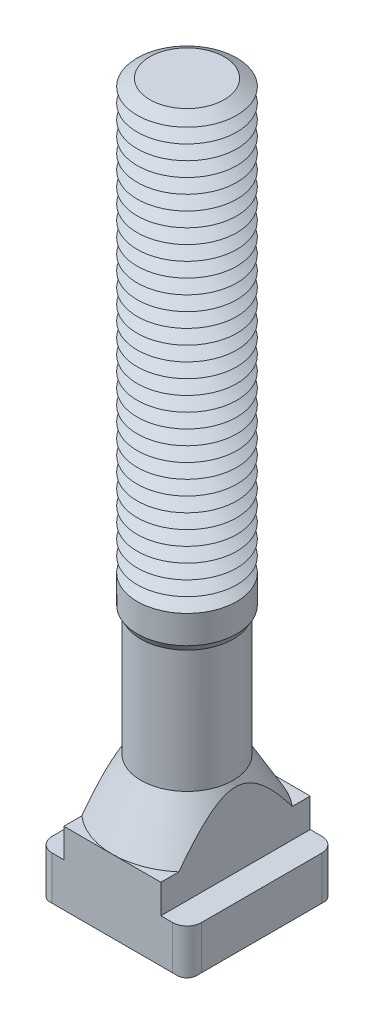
ISO-10303-21;
HEADER;
FILE_DESCRIPTION(('STEP AP214'),'2;1');
FILE_NAME('part.step','',(''),(''),'','','');
FILE_SCHEMA(('AUTOMOTIVE_DESIGN { 1 0 10303 214 1 1 1 1 }'));
ENDSEC;
DATA;
#1=APPLICATION_CONTEXT('core data for automotive mechanical design processes');
#2=APPLICATION_PROTOCOL_DEFINITION('international standard','automotive_design',2000,#1);
#3=PRODUCT_CONTEXT('',#1,'mechanical');
#4=PRODUCT('Part','Part','',(#3));
#5=PRODUCT_RELATED_PRODUCT_CATEGORY('part','',(#4));
#6=PRODUCT_DEFINITION_FORMATION('','',#4);
#7=PRODUCT_DEFINITION_CONTEXT('part definition',#1,'design');
#8=PRODUCT_DEFINITION('design','',#6,#7);
#9=PRODUCT_DEFINITION_SHAPE('','',#8);
#10=(LENGTH_UNIT() NAMED_UNIT(*) SI_UNIT(.MILLI.,.METRE.));
#11=(NAMED_UNIT(*) PLANE_ANGLE_UNIT() SI_UNIT($,.RADIAN.));
#12=(NAMED_UNIT(*) SI_UNIT($,.STERADIAN.) SOLID_ANGLE_UNIT());
#13=UNCERTAINTY_MEASURE_WITH_UNIT(LENGTH_MEASURE(1.E-05),#10,'distance_accuracy_value','');
#14=(GEOMETRIC_REPRESENTATION_CONTEXT(3) GLOBAL_UNCERTAINTY_ASSIGNED_CONTEXT((#13)) GLOBAL_UNIT_ASSIGNED_CONTEXT((#10,
#11,#12)) REPRESENTATION_CONTEXT('',''));
#15=CARTESIAN_POINT('',(0.,0.,0.));
#16=DIRECTION('',(0.,0.,1.));
#17=DIRECTION('',(1.,0.,0.));
#18=AXIS2_PLACEMENT_3D('',#15,#16,#17);
#19=CARTESIAN_POINT('',(0.,80.,0.));
#20=DIRECTION('',(0.,-1.,0.));
#21=DIRECTION('',(0.,0.,-1.));
#22=AXIS2_PLACEMENT_3D('',#19,#20,#21);
#23=CONICAL_SURFACE('',#22,4.48445554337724,1.0471975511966);
#24=CARTESIAN_POINT('',(0.,79.125,0.));
#25=DIRECTION('',(0.,-1.,0.));
#26=DIRECTION('',(0.,0.,-1.));
#27=AXIS2_PLACEMENT_3D('',#24,#25,#26);
#28=CIRCLE('',#27,6.00000000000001);
#29=CARTESIAN_POINT('',(0.,79.125,-6.00000000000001));
#30=VERTEX_POINT('',#29);
#31=EDGE_CURVE('E646',#30,#30,#28,.T.);
#32=ORIENTED_EDGE('',*,*,#31,.F.);
#33=EDGE_LOOP('',(#32));
#34=FACE_BOUND('',#33,.T.);
#35=CARTESIAN_POINT('',(0.,80.,0.));
#36=DIRECTION('',(0.,-1.,0.));
#37=DIRECTION('',(0.,0.,-1.));
#38=AXIS2_PLACEMENT_3D('',#35,#36,#37);
#39=CIRCLE('',#38,4.48445554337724);
#40=CARTESIAN_POINT('',(0.,80.,-4.48445554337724));
#41=VERTEX_POINT('',#40);
#42=EDGE_CURVE('E648',#41,#41,#39,.T.);
#43=ORIENTED_EDGE('',*,*,#42,.T.);
#44=EDGE_LOOP('',(#43));
#45=FACE_BOUND('',#44,.T.);
#46=ADVANCED_FACE('F39',(#34,#45),#23,.T.);
#47=CARTESIAN_POINT('',(0.,80.875,0.));
#48=DIRECTION('',(0.,1.,0.));
#49=DIRECTION('',(0.,0.,1.));
#50=AXIS2_PLACEMENT_3D('',#47,#48,#49);
#51=CONICAL_SURFACE('',#50,6.00000000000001,1.0471975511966);
#52=ORIENTED_EDGE('',*,*,#42,.F.);
#53=EDGE_LOOP('',(#52));
#54=FACE_BOUND('',#53,.T.);
#55=CARTESIAN_POINT('',(0.,80.875,0.));
#56=DIRECTION('',(0.,-1.,0.));
#57=DIRECTION('',(0.,0.,-1.));
#58=AXIS2_PLACEMENT_3D('',#55,#56,#57);
#59=CIRCLE('',#58,6.00000000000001);
#60=CARTESIAN_POINT('',(0.,80.875,-6.00000000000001));
#61=VERTEX_POINT('',#60);
#62=EDGE_CURVE('E654',#61,#61,#59,.T.);
#63=ORIENTED_EDGE('',*,*,#62,.T.);
#64=EDGE_LOOP('',(#63));
#65=FACE_BOUND('',#64,.T.);
#66=ADVANCED_FACE('F448',(#54,#65),#51,.T.);
#67=CARTESIAN_POINT('',(2.99938788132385,87.,0.));
#68=DIRECTION('',(0.,-1.,0.));
#69=DIRECTION('',(1.,0.,0.));
#70=AXIS2_PLACEMENT_3D('',#67,#68,#69);
#71=PLANE('',#70);
#72=CARTESIAN_POINT('',(0.,87.,0.));
#73=DIRECTION('',(0.,-1.,0.));
#74=DIRECTION('',(0.,0.,-1.));
#75=AXIS2_PLACEMENT_3D('',#72,#73,#74);
#76=CIRCLE('',#75,4.48445554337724);
#77=CARTESIAN_POINT('',(0.,87.,-4.48445554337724));
#78=VERTEX_POINT('',#77);
#79=EDGE_CURVE('E643',#78,#78,#76,.T.);
#80=ORIENTED_EDGE('',*,*,#79,.F.);
#81=EDGE_LOOP('',(#80));
#82=FACE_BOUND('',#81,.T.);
#83=ADVANCED_FACE('F454',(#82),#71,.F.);
#84=CARTESIAN_POINT('',(0.,87.,0.));
#85=DIRECTION('',(0.,-1.,0.));
#86=DIRECTION('',(0.,0.,-1.));
#87=AXIS2_PLACEMENT_3D('',#84,#85,#86);
#88=CONICAL_SURFACE('',#87,4.48445554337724,1.0471975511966);
#89=CARTESIAN_POINT('',(0.,86.125,0.));
#90=DIRECTION('',(0.,-1.,0.));
#91=DIRECTION('',(0.,0.,-1.));
#92=AXIS2_PLACEMENT_3D('',#89,#90,#91);
#93=CIRCLE('',#92,6.00000000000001);
#94=CARTESIAN_POINT('',(0.,86.125,-6.00000000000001));
#95=VERTEX_POINT('',#94);
#96=EDGE_CURVE('E640',#95,#95,#93,.T.);
#97=ORIENTED_EDGE('',*,*,#96,.F.);
#98=EDGE_LOOP('',(#97));
#99=FACE_BOUND('',#98,.T.);
#100=ORIENTED_EDGE('',*,*,#79,.T.);
#101=EDGE_LOOP('',(#100));
#102=FACE_BOUND('',#101,.T.);
#103=ADVANCED_FACE('F482',(#99,#102),#88,.T.);
#104=CARTESIAN_POINT('',(0.,86.125,0.));
#105=DIRECTION('',(0.,1.,0.));
#106=DIRECTION('',(0.,0.,1.));
#107=AXIS2_PLACEMENT_3D('',#104,#105,#106);
#108=CONICAL_SURFACE('',#107,6.00000000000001,1.0471975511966);
#109=CARTESIAN_POINT('',(0.,85.25,0.));
#110=DIRECTION('',(0.,-1.,0.));
#111=DIRECTION('',(0.,0.,-1.));
#112=AXIS2_PLACEMENT_3D('',#109,#110,#111);
#113=CIRCLE('',#112,4.48445554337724);
#114=CARTESIAN_POINT('',(0.,85.25,-4.48445554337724));
#115=VERTEX_POINT('',#114);
#116=EDGE_CURVE('E644',#115,#115,#113,.T.);
#117=ORIENTED_EDGE('',*,*,#116,.F.);
#118=EDGE_LOOP('',(#117));
#119=FACE_BOUND('',#118,.T.);
#120=ORIENTED_EDGE('',*,*,#96,.T.);
#121=EDGE_LOOP('',(#120));
#122=FACE_BOUND('',#121,.T.);
#123=ADVANCED_FACE('F479',(#119,#122),#108,.T.);
#124=CARTESIAN_POINT('',(0.,85.25,0.));
#125=DIRECTION('',(0.,-1.,0.));
#126=DIRECTION('',(0.,0.,-1.));
#127=AXIS2_PLACEMENT_3D('',#124,#125,#126);
#128=CONICAL_SURFACE('',#127,4.48445554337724,1.0471975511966);
#129=CARTESIAN_POINT('',(0.,84.375,0.));
#130=DIRECTION('',(0.,-1.,0.));
#131=DIRECTION('',(0.,0.,-1.));
#132=AXIS2_PLACEMENT_3D('',#129,#130,#131);
#133=CIRCLE('',#132,6.00000000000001);
#134=CARTESIAN_POINT('',(0.,84.375,-6.00000000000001));
#135=VERTEX_POINT('',#134);
#136=EDGE_CURVE('E676',#135,#135,#133,.T.);
#137=ORIENTED_EDGE('',*,*,#136,.F.);
#138=EDGE_LOOP('',(#137));
#139=FACE_BOUND('',#138,.T.);
#140=ORIENTED_EDGE('',*,*,#116,.T.);
#141=EDGE_LOOP('',(#140));
#142=FACE_BOUND('',#141,.T.);
#143=ADVANCED_FACE('F474',(#139,#142),#128,.T.);
#144=CARTESIAN_POINT('',(0.,84.375,0.));
#145=DIRECTION('',(0.,1.,0.));
#146=DIRECTION('',(0.,0.,1.));
#147=AXIS2_PLACEMENT_3D('',#144,#145,#146);
#148=CONICAL_SURFACE('',#147,6.00000000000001,1.0471975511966);
#149=CARTESIAN_POINT('',(0.,83.5,0.));
#150=DIRECTION('',(0.,-1.,0.));
#151=DIRECTION('',(0.,0.,-1.));
#152=AXIS2_PLACEMENT_3D('',#149,#150,#151);
#153=CIRCLE('',#152,4.48445554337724);
#154=CARTESIAN_POINT('',(0.,83.5,-4.48445554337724));
#155=VERTEX_POINT('',#154);
#156=EDGE_CURVE('E672',#155,#155,#153,.T.);
#157=ORIENTED_EDGE('',*,*,#156,.F.);
#158=EDGE_LOOP('',(#157));
#159=FACE_BOUND('',#158,.T.);
#160=ORIENTED_EDGE('',*,*,#136,.T.);
#161=EDGE_LOOP('',(#160));
#162=FACE_BOUND('',#161,.T.);
#163=ADVANCED_FACE('F471',(#159,#162),#148,.T.);
#164=CARTESIAN_POINT('',(0.,83.5,0.));
#165=DIRECTION('',(0.,-1.,0.));
#166=DIRECTION('',(0.,0.,-1.));
#167=AXIS2_PLACEMENT_3D('',#164,#165,#166);
#168=CONICAL_SURFACE('',#167,4.48445554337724,1.0471975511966);
#169=CARTESIAN_POINT('',(0.,82.625,0.));
#170=DIRECTION('',(0.,-1.,0.));
#171=DIRECTION('',(0.,0.,-1.));
#172=AXIS2_PLACEMENT_3D('',#169,#170,#171);
#173=CIRCLE('',#172,6.00000000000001);
#174=CARTESIAN_POINT('',(0.,82.625,-6.00000000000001));
#175=VERTEX_POINT('',#174);
#176=EDGE_CURVE('E668',#175,#175,#173,.T.);
#177=ORIENTED_EDGE('',*,*,#176,.F.);
#178=EDGE_LOOP('',(#177));
#179=FACE_BOUND('',#178,.T.);
#180=ORIENTED_EDGE('',*,*,#156,.T.);
#181=EDGE_LOOP('',(#180));
#182=FACE_BOUND('',#181,.T.);
#183=ADVANCED_FACE('F465',(#179,#182),#168,.T.);
#184=CARTESIAN_POINT('',(0.,82.625,0.));
#185=DIRECTION('',(0.,1.,0.));
#186=DIRECTION('',(0.,0.,1.));
#187=AXIS2_PLACEMENT_3D('',#184,#185,#186);
#188=CONICAL_SURFACE('',#187,6.00000000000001,1.0471975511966);
#189=CARTESIAN_POINT('',(0.,81.75,0.));
#190=DIRECTION('',(0.,-1.,0.));
#191=DIRECTION('',(0.,0.,-1.));
#192=AXIS2_PLACEMENT_3D('',#189,#190,#191);
#193=CIRCLE('',#192,4.48445554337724);
#194=CARTESIAN_POINT('',(0.,81.75,-4.48445554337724));
#195=VERTEX_POINT('',#194);
#196=EDGE_CURVE('E664',#195,#195,#193,.T.);
#197=ORIENTED_EDGE('',*,*,#196,.F.);
#198=EDGE_LOOP('',(#197));
#199=FACE_BOUND('',#198,.T.);
#200=ORIENTED_EDGE('',*,*,#176,.T.);
#201=EDGE_LOOP('',(#200));
#202=FACE_BOUND('',#201,.T.);
#203=ADVANCED_FACE('F461',(#199,#202),#188,.T.);
#204=CARTESIAN_POINT('',(0.,81.75,0.));
#205=DIRECTION('',(0.,-1.,0.));
#206=DIRECTION('',(0.,0.,-1.));
#207=AXIS2_PLACEMENT_3D('',#204,#205,#206);
#208=CONICAL_SURFACE('',#207,4.48445554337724,1.0471975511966);
#209=ORIENTED_EDGE('',*,*,#62,.F.);
#210=EDGE_LOOP('',(#209));
#211=FACE_BOUND('',#210,.T.);
#212=ORIENTED_EDGE('',*,*,#196,.T.);
#213=EDGE_LOOP('',(#212));
#214=FACE_BOUND('',#213,.T.);
#215=ADVANCED_FACE('F464',(#211,#214),#208,.T.);
#216=CARTESIAN_POINT('',(0.,78.25,0.));
#217=DIRECTION('',(0.,-1.,0.));
#218=DIRECTION('',(0.,0.,-1.));
#219=AXIS2_PLACEMENT_3D('',#216,#217,#218);
#220=CONICAL_SURFACE('',#219,4.48445554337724,1.0471975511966);
#221=CARTESIAN_POINT('',(0.,77.375,0.));
#222=DIRECTION('',(0.,-1.,0.));
#223=DIRECTION('',(0.,0.,-1.));
#224=AXIS2_PLACEMENT_3D('',#221,#222,#223);
#225=CIRCLE('',#224,6.00000000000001);
#226=CARTESIAN_POINT('',(0.,77.375,-6.00000000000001));
#227=VERTEX_POINT('',#226);
#228=EDGE_CURVE('E657',#227,#227,#225,.T.);
#229=ORIENTED_EDGE('',*,*,#228,.F.);
#230=EDGE_LOOP('',(#229));
#231=FACE_BOUND('',#230,.T.);
#232=CARTESIAN_POINT('',(0.,78.25,0.));
#233=DIRECTION('',(0.,-1.,0.));
#234=DIRECTION('',(0.,0.,-1.));
#235=AXIS2_PLACEMENT_3D('',#232,#233,#234);
#236=CIRCLE('',#235,4.48445554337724);
#237=CARTESIAN_POINT('',(0.,78.25,-4.48445554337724));
#238=VERTEX_POINT('',#237);
#239=EDGE_CURVE('E649',#238,#238,#236,.T.);
#240=ORIENTED_EDGE('',*,*,#239,.T.);
#241=EDGE_LOOP('',(#240));
#242=FACE_BOUND('',#241,.T.);
#243=ADVANCED_FACE('F469',(#231,#242),#220,.T.);
#244=CARTESIAN_POINT('',(0.,79.125,0.));
#245=DIRECTION('',(0.,1.,0.));
#246=DIRECTION('',(0.,0.,1.));
#247=AXIS2_PLACEMENT_3D('',#244,#245,#246);
#248=CONICAL_SURFACE('',#247,6.00000000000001,1.0471975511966);
#249=ORIENTED_EDGE('',*,*,#239,.F.);
#250=EDGE_LOOP('',(#249));
#251=FACE_BOUND('',#250,.T.);
#252=ORIENTED_EDGE('',*,*,#31,.T.);
#253=EDGE_LOOP('',(#252));
#254=FACE_BOUND('',#253,.T.);
#255=ADVANCED_FACE('F767',(#251,#254),#248,.T.);
#256=CARTESIAN_POINT('',(0.,76.5,0.));
#257=DIRECTION('',(0.,-1.,0.));
#258=DIRECTION('',(0.,0.,-1.));
#259=AXIS2_PLACEMENT_3D('',#256,#257,#258);
#260=CONICAL_SURFACE('',#259,4.48445554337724,1.0471975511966);
#261=CARTESIAN_POINT('',(0.,75.625,0.));
#262=DIRECTION('',(0.,-1.,0.));
#263=DIRECTION('',(0.,0.,-1.));
#264=AXIS2_PLACEMENT_3D('',#261,#262,#263);
#265=CIRCLE('',#264,6.00000000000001);
#266=CARTESIAN_POINT('',(0.,75.625,-6.00000000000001));
#267=VERTEX_POINT('',#266);
#268=EDGE_CURVE('E752',#267,#267,#265,.T.);
#269=ORIENTED_EDGE('',*,*,#268,.F.);
#270=EDGE_LOOP('',(#269));
#271=FACE_BOUND('',#270,.T.);
#272=CARTESIAN_POINT('',(0.,76.5,0.));
#273=DIRECTION('',(0.,-1.,0.));
#274=DIRECTION('',(0.,0.,-1.));
#275=AXIS2_PLACEMENT_3D('',#272,#273,#274);
#276=CIRCLE('',#275,4.48445554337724);
#277=CARTESIAN_POINT('',(0.,76.5,-4.48445554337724));
#278=VERTEX_POINT('',#277);
#279=EDGE_CURVE('E756',#278,#278,#276,.T.);
#280=ORIENTED_EDGE('',*,*,#279,.T.);
#281=EDGE_LOOP('',(#280));
#282=FACE_BOUND('',#281,.T.);
#283=ADVANCED_FACE('F771',(#271,#282),#260,.T.);
#284=CARTESIAN_POINT('',(0.,77.375,0.));
#285=DIRECTION('',(0.,1.,0.));
#286=DIRECTION('',(0.,0.,1.));
#287=AXIS2_PLACEMENT_3D('',#284,#285,#286);
#288=CONICAL_SURFACE('',#287,6.00000000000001,1.0471975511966);
#289=ORIENTED_EDGE('',*,*,#279,.F.);
#290=EDGE_LOOP('',(#289));
#291=FACE_BOUND('',#290,.T.);
#292=ORIENTED_EDGE('',*,*,#228,.T.);
#293=EDGE_LOOP('',(#292));
#294=FACE_BOUND('',#293,.T.);
#295=ADVANCED_FACE('F763',(#291,#294),#288,.T.);
#296=CARTESIAN_POINT('',(0.,74.75,0.));
#297=DIRECTION('',(0.,-1.,0.));
#298=DIRECTION('',(0.,0.,-1.));
#299=AXIS2_PLACEMENT_3D('',#296,#297,#298);
#300=CONICAL_SURFACE('',#299,4.48445554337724,1.0471975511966);
#301=CARTESIAN_POINT('',(0.,73.875,0.));
#302=DIRECTION('',(0.,-1.,0.));
#303=DIRECTION('',(0.,0.,-1.));
#304=AXIS2_PLACEMENT_3D('',#301,#302,#303);
#305=CIRCLE('',#304,6.00000000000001);
#306=CARTESIAN_POINT('',(0.,73.875,-6.00000000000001));
#307=VERTEX_POINT('',#306);
#308=EDGE_CURVE('E745',#307,#307,#305,.T.);
#309=ORIENTED_EDGE('',*,*,#308,.F.);
#310=EDGE_LOOP('',(#309));
#311=FACE_BOUND('',#310,.T.);
#312=CARTESIAN_POINT('',(0.,74.75,0.));
#313=DIRECTION('',(0.,-1.,0.));
#314=DIRECTION('',(0.,0.,-1.));
#315=AXIS2_PLACEMENT_3D('',#312,#313,#314);
#316=CIRCLE('',#315,4.48445554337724);
#317=CARTESIAN_POINT('',(0.,74.75,-4.48445554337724));
#318=VERTEX_POINT('',#317);
#319=EDGE_CURVE('E748',#318,#318,#316,.T.);
#320=ORIENTED_EDGE('',*,*,#319,.T.);
#321=EDGE_LOOP('',(#320));
#322=FACE_BOUND('',#321,.T.);
#323=ADVANCED_FACE('F781',(#311,#322),#300,.T.);
#324=CARTESIAN_POINT('',(0.,75.625,0.));
#325=DIRECTION('',(0.,1.,0.));
#326=DIRECTION('',(0.,0.,1.));
#327=AXIS2_PLACEMENT_3D('',#324,#325,#326);
#328=CONICAL_SURFACE('',#327,6.00000000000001,1.0471975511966);
#329=ORIENTED_EDGE('',*,*,#319,.F.);
#330=EDGE_LOOP('',(#329));
#331=FACE_BOUND('',#330,.T.);
#332=ORIENTED_EDGE('',*,*,#268,.T.);
#333=EDGE_LOOP('',(#332));
#334=FACE_BOUND('',#333,.T.);
#335=ADVANCED_FACE('F785',(#331,#334),#328,.T.);
#336=CARTESIAN_POINT('',(0.,73.,0.));
#337=DIRECTION('',(0.,-1.,0.));
#338=DIRECTION('',(0.,0.,-1.));
#339=AXIS2_PLACEMENT_3D('',#336,#337,#338);
#340=CONICAL_SURFACE('',#339,4.48445554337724,1.0471975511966);
#341=CARTESIAN_POINT('',(0.,72.125,0.));
#342=DIRECTION('',(0.,-1.,0.));
#343=DIRECTION('',(0.,0.,-1.));
#344=AXIS2_PLACEMENT_3D('',#341,#342,#343);
#345=CIRCLE('',#344,6.00000000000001);
#346=CARTESIAN_POINT('',(0.,72.125,-6.00000000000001));
#347=VERTEX_POINT('',#346);
#348=EDGE_CURVE('E737',#347,#347,#345,.T.);
#349=ORIENTED_EDGE('',*,*,#348,.F.);
#350=EDGE_LOOP('',(#349));
#351=FACE_BOUND('',#350,.T.);
#352=CARTESIAN_POINT('',(0.,73.,0.));
#353=DIRECTION('',(0.,-1.,0.));
#354=DIRECTION('',(0.,0.,-1.));
#355=AXIS2_PLACEMENT_3D('',#352,#353,#354);
#356=CIRCLE('',#355,4.48445554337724);
#357=CARTESIAN_POINT('',(0.,73.,-4.48445554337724));
#358=VERTEX_POINT('',#357);
#359=EDGE_CURVE('E741',#358,#358,#356,.T.);
#360=ORIENTED_EDGE('',*,*,#359,.T.);
#361=EDGE_LOOP('',(#360));
#362=FACE_BOUND('',#361,.T.);
#363=ADVANCED_FACE('F789',(#351,#362),#340,.T.);
#364=CARTESIAN_POINT('',(0.,73.875,0.));
#365=DIRECTION('',(0.,1.,0.));
#366=DIRECTION('',(0.,0.,1.));
#367=AXIS2_PLACEMENT_3D('',#364,#365,#366);
#368=CONICAL_SURFACE('',#367,6.00000000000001,1.0471975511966);
#369=ORIENTED_EDGE('',*,*,#359,.F.);
#370=EDGE_LOOP('',(#369));
#371=FACE_BOUND('',#370,.T.);
#372=ORIENTED_EDGE('',*,*,#308,.T.);
#373=EDGE_LOOP('',(#372));
#374=FACE_BOUND('',#373,.T.);
#375=ADVANCED_FACE('F793',(#371,#374),#368,.T.);
#376=CARTESIAN_POINT('',(0.,71.25,0.));
#377=DIRECTION('',(0.,-1.,0.));
#378=DIRECTION('',(0.,0.,-1.));
#379=AXIS2_PLACEMENT_3D('',#376,#377,#378);
#380=CONICAL_SURFACE('',#379,4.48445554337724,1.0471975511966);
#381=CARTESIAN_POINT('',(0.,70.375,0.));
#382=DIRECTION('',(0.,-1.,0.));
#383=DIRECTION('',(0.,0.,-1.));
#384=AXIS2_PLACEMENT_3D('',#381,#382,#383);
#385=CIRCLE('',#384,6.00000000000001);
#386=CARTESIAN_POINT('',(0.,70.375,-6.00000000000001));
#387=VERTEX_POINT('',#386);
#388=EDGE_CURVE('E729',#387,#387,#385,.T.);
#389=ORIENTED_EDGE('',*,*,#388,.F.);
#390=EDGE_LOOP('',(#389));
#391=FACE_BOUND('',#390,.T.);
#392=CARTESIAN_POINT('',(0.,71.25,0.));
#393=DIRECTION('',(0.,-1.,0.));
#394=DIRECTION('',(0.,0.,-1.));
#395=AXIS2_PLACEMENT_3D('',#392,#393,#394);
#396=CIRCLE('',#395,4.48445554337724);
#397=CARTESIAN_POINT('',(0.,71.25,-4.48445554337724));
#398=VERTEX_POINT('',#397);
#399=EDGE_CURVE('E733',#398,#398,#396,.T.);
#400=ORIENTED_EDGE('',*,*,#399,.T.);
#401=EDGE_LOOP('',(#400));
#402=FACE_BOUND('',#401,.T.);
#403=ADVANCED_FACE('F797',(#391,#402),#380,.T.);
#404=CARTESIAN_POINT('',(0.,72.125,0.));
#405=DIRECTION('',(0.,1.,0.));
#406=DIRECTION('',(0.,0.,1.));
#407=AXIS2_PLACEMENT_3D('',#404,#405,#406);
#408=CONICAL_SURFACE('',#407,6.00000000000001,1.0471975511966);
#409=ORIENTED_EDGE('',*,*,#399,.F.);
#410=EDGE_LOOP('',(#409));
#411=FACE_BOUND('',#410,.T.);
#412=ORIENTED_EDGE('',*,*,#348,.T.);
#413=EDGE_LOOP('',(#412));
#414=FACE_BOUND('',#413,.T.);
#415=ADVANCED_FACE('F801',(#411,#414),#408,.T.);
#416=CARTESIAN_POINT('',(0.,69.5,0.));
#417=DIRECTION('',(0.,-1.,0.));
#418=DIRECTION('',(0.,0.,-1.));
#419=AXIS2_PLACEMENT_3D('',#416,#417,#418);
#420=CONICAL_SURFACE('',#419,4.48445554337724,1.0471975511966);
#421=CARTESIAN_POINT('',(0.,68.625,0.));
#422=DIRECTION('',(0.,-1.,0.));
#423=DIRECTION('',(0.,0.,-1.));
#424=AXIS2_PLACEMENT_3D('',#421,#422,#423);
#425=CIRCLE('',#424,6.00000000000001);
#426=CARTESIAN_POINT('',(0.,68.625,-6.00000000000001));
#427=VERTEX_POINT('',#426);
#428=EDGE_CURVE('E714',#427,#427,#425,.T.);
#429=ORIENTED_EDGE('',*,*,#428,.F.);
#430=EDGE_LOOP('',(#429));
#431=FACE_BOUND('',#430,.T.);
#432=CARTESIAN_POINT('',(0.,69.5,0.));
#433=DIRECTION('',(0.,-1.,0.));
#434=DIRECTION('',(0.,0.,-1.));
#435=AXIS2_PLACEMENT_3D('',#432,#433,#434);
#436=CIRCLE('',#435,4.48445554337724);
#437=CARTESIAN_POINT('',(0.,69.5,-4.48445554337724));
#438=VERTEX_POINT('',#437);
#439=EDGE_CURVE('E725',#438,#438,#436,.T.);
#440=ORIENTED_EDGE('',*,*,#439,.T.);
#441=EDGE_LOOP('',(#440));
#442=FACE_BOUND('',#441,.T.);
#443=ADVANCED_FACE('F805',(#431,#442),#420,.T.);
#444=CARTESIAN_POINT('',(0.,70.375,0.));
#445=DIRECTION('',(0.,1.,0.));
#446=DIRECTION('',(0.,0.,1.));
#447=AXIS2_PLACEMENT_3D('',#444,#445,#446);
#448=CONICAL_SURFACE('',#447,6.00000000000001,1.0471975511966);
#449=ORIENTED_EDGE('',*,*,#439,.F.);
#450=EDGE_LOOP('',(#449));
#451=FACE_BOUND('',#450,.T.);
#452=ORIENTED_EDGE('',*,*,#388,.T.);
#453=EDGE_LOOP('',(#452));
#454=FACE_BOUND('',#453,.T.);
#455=ADVANCED_FACE('F809',(#451,#454),#448,.T.);
#456=CARTESIAN_POINT('',(0.,67.75,0.));
#457=DIRECTION('',(0.,-1.,0.));
#458=DIRECTION('',(0.,0.,-1.));
#459=AXIS2_PLACEMENT_3D('',#456,#457,#458);
#460=CONICAL_SURFACE('',#459,4.48445554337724,1.0471975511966);
#461=CARTESIAN_POINT('',(0.,66.875,0.));
#462=DIRECTION('',(0.,-1.,0.));
#463=DIRECTION('',(0.,0.,-1.));
#464=AXIS2_PLACEMENT_3D('',#461,#462,#463);
#465=CIRCLE('',#464,6.00000000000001);
#466=CARTESIAN_POINT('',(0.,66.875,-6.00000000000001));
#467=VERTEX_POINT('',#466);
#468=EDGE_CURVE('E705',#467,#467,#465,.T.);
#469=ORIENTED_EDGE('',*,*,#468,.F.);
#470=EDGE_LOOP('',(#469));
#471=FACE_BOUND('',#470,.T.);
#472=CARTESIAN_POINT('',(0.,67.75,0.));
#473=DIRECTION('',(0.,-1.,0.));
#474=DIRECTION('',(0.,0.,-1.));
#475=AXIS2_PLACEMENT_3D('',#472,#473,#474);
#476=CIRCLE('',#475,4.48445554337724);
#477=CARTESIAN_POINT('',(0.,67.75,-4.48445554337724));
#478=VERTEX_POINT('',#477);
#479=EDGE_CURVE('E707',#478,#478,#476,.T.);
#480=ORIENTED_EDGE('',*,*,#479,.T.);
#481=EDGE_LOOP('',(#480));
#482=FACE_BOUND('',#481,.T.);
#483=ADVANCED_FACE('F813',(#471,#482),#460,.T.);
#484=CARTESIAN_POINT('',(0.,68.625,0.));
#485=DIRECTION('',(0.,1.,0.));
#486=DIRECTION('',(0.,0.,1.));
#487=AXIS2_PLACEMENT_3D('',#484,#485,#486);
#488=CONICAL_SURFACE('',#487,6.00000000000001,1.0471975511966);
#489=ORIENTED_EDGE('',*,*,#479,.F.);
#490=EDGE_LOOP('',(#489));
#491=FACE_BOUND('',#490,.T.);
#492=ORIENTED_EDGE('',*,*,#428,.T.);
#493=EDGE_LOOP('',(#492));
#494=FACE_BOUND('',#493,.T.);
#495=ADVANCED_FACE('F817',(#491,#494),#488,.T.);
#496=CARTESIAN_POINT('',(0.,66.,0.));
#497=DIRECTION('',(0.,-1.,0.));
#498=DIRECTION('',(0.,0.,-1.));
#499=AXIS2_PLACEMENT_3D('',#496,#497,#498);
#500=CONICAL_SURFACE('',#499,4.48445554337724,1.0471975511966);
#501=CARTESIAN_POINT('',(0.,65.125,0.));
#502=DIRECTION('',(0.,-1.,0.));
#503=DIRECTION('',(0.,0.,-1.));
#504=AXIS2_PLACEMENT_3D('',#501,#502,#503);
#505=CIRCLE('',#504,6.00000000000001);
#506=CARTESIAN_POINT('',(0.,65.125,-6.00000000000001));
#507=VERTEX_POINT('',#506);
#508=EDGE_CURVE('E718',#507,#507,#505,.T.);
#509=ORIENTED_EDGE('',*,*,#508,.F.);
#510=EDGE_LOOP('',(#509));
#511=FACE_BOUND('',#510,.T.);
#512=CARTESIAN_POINT('',(0.,66.,0.));
#513=DIRECTION('',(0.,-1.,0.));
#514=DIRECTION('',(0.,0.,-1.));
#515=AXIS2_PLACEMENT_3D('',#512,#513,#514);
#516=CIRCLE('',#515,4.48445554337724);
#517=CARTESIAN_POINT('',(0.,66.,-4.48445554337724));
#518=VERTEX_POINT('',#517);
#519=EDGE_CURVE('E708',#518,#518,#516,.T.);
#520=ORIENTED_EDGE('',*,*,#519,.T.);
#521=EDGE_LOOP('',(#520));
#522=FACE_BOUND('',#521,.T.);
#523=ADVANCED_FACE('F821',(#511,#522),#500,.T.);
#524=CARTESIAN_POINT('',(0.,66.875,0.));
#525=DIRECTION('',(0.,1.,0.));
#526=DIRECTION('',(0.,0.,1.));
#527=AXIS2_PLACEMENT_3D('',#524,#525,#526);
#528=CONICAL_SURFACE('',#527,6.00000000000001,1.0471975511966);
#529=ORIENTED_EDGE('',*,*,#519,.F.);
#530=EDGE_LOOP('',(#529));
#531=FACE_BOUND('',#530,.T.);
#532=ORIENTED_EDGE('',*,*,#468,.T.);
#533=EDGE_LOOP('',(#532));
#534=FACE_BOUND('',#533,.T.);
#535=ADVANCED_FACE('F825',(#531,#534),#528,.T.);
#536=CARTESIAN_POINT('',(0.,64.25,0.));
#537=DIRECTION('',(0.,-1.,0.));
#538=DIRECTION('',(0.,0.,-1.));
#539=AXIS2_PLACEMENT_3D('',#536,#537,#538);
#540=CONICAL_SURFACE('',#539,4.48445554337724,1.0471975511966);
#541=CARTESIAN_POINT('',(0.,63.375,0.));
#542=DIRECTION('',(0.,-1.,0.));
#543=DIRECTION('',(0.,0.,-1.));
#544=AXIS2_PLACEMENT_3D('',#541,#542,#543);
#545=CIRCLE('',#544,6.00000000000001);
#546=CARTESIAN_POINT('',(0.,63.375,-6.00000000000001));
#547=VERTEX_POINT('',#546);
#548=EDGE_CURVE('E1079',#547,#547,#545,.T.);
#549=ORIENTED_EDGE('',*,*,#548,.F.);
#550=EDGE_LOOP('',(#549));
#551=FACE_BOUND('',#550,.T.);
#552=CARTESIAN_POINT('',(0.,64.25,0.));
#553=DIRECTION('',(0.,-1.,0.));
#554=DIRECTION('',(0.,0.,-1.));
#555=AXIS2_PLACEMENT_3D('',#552,#553,#554);
#556=CIRCLE('',#555,4.48445554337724);
#557=CARTESIAN_POINT('',(0.,64.25,-4.48445554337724));
#558=VERTEX_POINT('',#557);
#559=EDGE_CURVE('E1083',#558,#558,#556,.T.);
#560=ORIENTED_EDGE('',*,*,#559,.T.);
#561=EDGE_LOOP('',(#560));
#562=FACE_BOUND('',#561,.T.);
#563=ADVANCED_FACE('F829',(#551,#562),#540,.T.);
#564=CARTESIAN_POINT('',(0.,65.125,0.));
#565=DIRECTION('',(0.,1.,0.));
#566=DIRECTION('',(0.,0.,1.));
#567=AXIS2_PLACEMENT_3D('',#564,#565,#566);
#568=CONICAL_SURFACE('',#567,6.00000000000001,1.0471975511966);
#569=ORIENTED_EDGE('',*,*,#559,.F.);
#570=EDGE_LOOP('',(#569));
#571=FACE_BOUND('',#570,.T.);
#572=ORIENTED_EDGE('',*,*,#508,.T.);
#573=EDGE_LOOP('',(#572));
#574=FACE_BOUND('',#573,.T.);
#575=ADVANCED_FACE('F833',(#571,#574),#568,.T.);
#576=CARTESIAN_POINT('',(0.,62.5,0.));
#577=DIRECTION('',(0.,-1.,0.));
#578=DIRECTION('',(0.,0.,-1.));
#579=AXIS2_PLACEMENT_3D('',#576,#577,#578);
#580=CONICAL_SURFACE('',#579,4.48445554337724,1.0471975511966);
#581=CARTESIAN_POINT('',(0.,61.625,0.));
#582=DIRECTION('',(0.,-1.,0.));
#583=DIRECTION('',(0.,0.,-1.));
#584=AXIS2_PLACEMENT_3D('',#581,#582,#583);
#585=CIRCLE('',#584,6.00000000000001);
#586=CARTESIAN_POINT('',(0.,61.625,-6.00000000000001));
#587=VERTEX_POINT('',#586);
#588=EDGE_CURVE('E1071',#587,#587,#585,.T.);
#589=ORIENTED_EDGE('',*,*,#588,.F.);
#590=EDGE_LOOP('',(#589));
#591=FACE_BOUND('',#590,.T.);
#592=CARTESIAN_POINT('',(0.,62.5,0.));
#593=DIRECTION('',(0.,-1.,0.));
#594=DIRECTION('',(0.,0.,-1.));
#595=AXIS2_PLACEMENT_3D('',#592,#593,#594);
#596=CIRCLE('',#595,4.48445554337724);
#597=CARTESIAN_POINT('',(0.,62.5,-4.48445554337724));
#598=VERTEX_POINT('',#597);
#599=EDGE_CURVE('E1075',#598,#598,#596,.T.);
#600=ORIENTED_EDGE('',*,*,#599,.T.);
#601=EDGE_LOOP('',(#600));
#602=FACE_BOUND('',#601,.T.);
#603=ADVANCED_FACE('F837',(#591,#602),#580,.T.);
#604=CARTESIAN_POINT('',(0.,63.375,0.));
#605=DIRECTION('',(0.,1.,0.));
#606=DIRECTION('',(0.,0.,1.));
#607=AXIS2_PLACEMENT_3D('',#604,#605,#606);
#608=CONICAL_SURFACE('',#607,6.00000000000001,1.0471975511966);
#609=ORIENTED_EDGE('',*,*,#599,.F.);
#610=EDGE_LOOP('',(#609));
#611=FACE_BOUND('',#610,.T.);
#612=ORIENTED_EDGE('',*,*,#548,.T.);
#613=EDGE_LOOP('',(#612));
#614=FACE_BOUND('',#613,.T.);
#615=ADVANCED_FACE('F841',(#611,#614),#608,.T.);
#616=CARTESIAN_POINT('',(0.,60.75,0.));
#617=DIRECTION('',(0.,-1.,0.));
#618=DIRECTION('',(0.,0.,-1.));
#619=AXIS2_PLACEMENT_3D('',#616,#617,#618);
#620=CONICAL_SURFACE('',#619,4.48445554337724,1.0471975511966);
#621=CARTESIAN_POINT('',(0.,59.875,0.));
#622=DIRECTION('',(0.,-1.,0.));
#623=DIRECTION('',(0.,0.,-1.));
#624=AXIS2_PLACEMENT_3D('',#621,#622,#623);
#625=CIRCLE('',#624,6.00000000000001);
#626=CARTESIAN_POINT('',(0.,59.875,-6.00000000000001));
#627=VERTEX_POINT('',#626);
#628=EDGE_CURVE('E631',#627,#627,#625,.T.);
#629=ORIENTED_EDGE('',*,*,#628,.F.);
#630=EDGE_LOOP('',(#629));
#631=FACE_BOUND('',#630,.T.);
#632=CARTESIAN_POINT('',(0.,60.75,0.));
#633=DIRECTION('',(0.,-1.,0.));
#634=DIRECTION('',(0.,0.,-1.));
#635=AXIS2_PLACEMENT_3D('',#632,#633,#634);
#636=CIRCLE('',#635,4.48445554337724);
#637=CARTESIAN_POINT('',(0.,60.75,-4.48445554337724));
#638=VERTEX_POINT('',#637);
#639=EDGE_CURVE('E1067',#638,#638,#636,.T.);
#640=ORIENTED_EDGE('',*,*,#639,.T.);
#641=EDGE_LOOP('',(#640));
#642=FACE_BOUND('',#641,.T.);
#643=ADVANCED_FACE('F845',(#631,#642),#620,.T.);
#644=CARTESIAN_POINT('',(0.,61.625,0.));
#645=DIRECTION('',(0.,1.,0.));
#646=DIRECTION('',(0.,0.,1.));
#647=AXIS2_PLACEMENT_3D('',#644,#645,#646);
#648=CONICAL_SURFACE('',#647,6.00000000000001,1.0471975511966);
#649=ORIENTED_EDGE('',*,*,#639,.F.);
#650=EDGE_LOOP('',(#649));
#651=FACE_BOUND('',#650,.T.);
#652=ORIENTED_EDGE('',*,*,#588,.T.);
#653=EDGE_LOOP('',(#652));
#654=FACE_BOUND('',#653,.T.);
#655=ADVANCED_FACE('F849',(#651,#654),#648,.T.);
#656=CARTESIAN_POINT('',(0.,59.,0.));
#657=DIRECTION('',(0.,-1.,0.));
#658=DIRECTION('',(0.,0.,-1.));
#659=AXIS2_PLACEMENT_3D('',#656,#657,#658);
#660=CONICAL_SURFACE('',#659,4.48445554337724,1.0471975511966);
#661=CARTESIAN_POINT('',(0.,58.125,0.));
#662=DIRECTION('',(0.,-1.,0.));
#663=DIRECTION('',(0.,0.,-1.));
#664=AXIS2_PLACEMENT_3D('',#661,#662,#663);
#665=CIRCLE('',#664,6.00000000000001);
#666=CARTESIAN_POINT('',(0.,58.125,-6.00000000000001));
#667=VERTEX_POINT('',#666);
#668=EDGE_CURVE('E702',#667,#667,#665,.T.);
#669=ORIENTED_EDGE('',*,*,#668,.F.);
#670=EDGE_LOOP('',(#669));
#671=FACE_BOUND('',#670,.T.);
#672=CARTESIAN_POINT('',(0.,59.,0.));
#673=DIRECTION('',(0.,-1.,0.));
#674=DIRECTION('',(0.,0.,-1.));
#675=AXIS2_PLACEMENT_3D('',#672,#673,#674);
#676=CIRCLE('',#675,4.48445554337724);
#677=CARTESIAN_POINT('',(0.,59.,-4.48445554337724));
#678=VERTEX_POINT('',#677);
#679=EDGE_CURVE('E1061',#678,#678,#676,.T.);
#680=ORIENTED_EDGE('',*,*,#679,.T.);
#681=EDGE_LOOP('',(#680));
#682=FACE_BOUND('',#681,.T.);
#683=ADVANCED_FACE('F853',(#671,#682),#660,.T.);
#684=CARTESIAN_POINT('',(0.,59.875,0.));
#685=DIRECTION('',(0.,1.,0.));
#686=DIRECTION('',(0.,0.,1.));
#687=AXIS2_PLACEMENT_3D('',#684,#685,#686);
#688=CONICAL_SURFACE('',#687,6.00000000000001,1.0471975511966);
#689=ORIENTED_EDGE('',*,*,#679,.F.);
#690=EDGE_LOOP('',(#689));
#691=FACE_BOUND('',#690,.T.);
#692=ORIENTED_EDGE('',*,*,#628,.T.);
#693=EDGE_LOOP('',(#692));
#694=FACE_BOUND('',#693,.T.);
#695=ADVANCED_FACE('F857',(#691,#694),#688,.T.);
#696=CARTESIAN_POINT('',(0.,57.25,0.));
#697=DIRECTION('',(0.,-1.,0.));
#698=DIRECTION('',(0.,0.,-1.));
#699=AXIS2_PLACEMENT_3D('',#696,#697,#698);
#700=CONICAL_SURFACE('',#699,4.48445554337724,1.0471975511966);
#701=CARTESIAN_POINT('',(0.,56.375,0.));
#702=DIRECTION('',(0.,-1.,0.));
#703=DIRECTION('',(0.,0.,-1.));
#704=AXIS2_PLACEMENT_3D('',#701,#702,#703);
#705=CIRCLE('',#704,6.00000000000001);
#706=CARTESIAN_POINT('',(0.,56.375,-6.00000000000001));
#707=VERTEX_POINT('',#706);
#708=EDGE_CURVE('E703',#707,#707,#705,.T.);
#709=ORIENTED_EDGE('',*,*,#708,.F.);
#710=EDGE_LOOP('',(#709));
#711=FACE_BOUND('',#710,.T.);
#712=CARTESIAN_POINT('',(0.,57.25,0.));
#713=DIRECTION('',(0.,-1.,0.));
#714=DIRECTION('',(0.,0.,-1.));
#715=AXIS2_PLACEMENT_3D('',#712,#713,#714);
#716=CIRCLE('',#715,4.48445554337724);
#717=CARTESIAN_POINT('',(0.,57.25,-4.48445554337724));
#718=VERTEX_POINT('',#717);
#719=EDGE_CURVE('E699',#718,#718,#716,.T.);
#720=ORIENTED_EDGE('',*,*,#719,.T.);
#721=EDGE_LOOP('',(#720));
#722=FACE_BOUND('',#721,.T.);
#723=ADVANCED_FACE('F861',(#711,#722),#700,.T.);
#724=CARTESIAN_POINT('',(0.,58.125,0.));
#725=DIRECTION('',(0.,1.,0.));
#726=DIRECTION('',(0.,0.,1.));
#727=AXIS2_PLACEMENT_3D('',#724,#725,#726);
#728=CONICAL_SURFACE('',#727,6.00000000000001,1.0471975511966);
#729=ORIENTED_EDGE('',*,*,#719,.F.);
#730=EDGE_LOOP('',(#729));
#731=FACE_BOUND('',#730,.T.);
#732=ORIENTED_EDGE('',*,*,#668,.T.);
#733=EDGE_LOOP('',(#732));
#734=FACE_BOUND('',#733,.T.);
#735=ADVANCED_FACE('F865',(#731,#734),#728,.T.);
#736=CARTESIAN_POINT('',(0.,55.5,0.));
#737=DIRECTION('',(0.,-1.,0.));
#738=DIRECTION('',(0.,0.,-1.));
#739=AXIS2_PLACEMENT_3D('',#736,#737,#738);
#740=CONICAL_SURFACE('',#739,4.48445554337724,1.0471975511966);
#741=CARTESIAN_POINT('',(0.,54.625,0.));
#742=DIRECTION('',(0.,-1.,0.));
#743=DIRECTION('',(0.,0.,-1.));
#744=AXIS2_PLACEMENT_3D('',#741,#742,#743);
#745=CIRCLE('',#744,6.00000000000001);
#746=CARTESIAN_POINT('',(0.,54.625,-6.00000000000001));
#747=VERTEX_POINT('',#746);
#748=EDGE_CURVE('E1047',#747,#747,#745,.T.);
#749=ORIENTED_EDGE('',*,*,#748,.F.);
#750=EDGE_LOOP('',(#749));
#751=FACE_BOUND('',#750,.T.);
#752=CARTESIAN_POINT('',(0.,55.5,0.));
#753=DIRECTION('',(0.,-1.,0.));
#754=DIRECTION('',(0.,0.,-1.));
#755=AXIS2_PLACEMENT_3D('',#752,#753,#754);
#756=CIRCLE('',#755,4.48445554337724);
#757=CARTESIAN_POINT('',(0.,55.5,-4.48445554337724));
#758=VERTEX_POINT('',#757);
#759=EDGE_CURVE('E1051',#758,#758,#756,.T.);
#760=ORIENTED_EDGE('',*,*,#759,.T.);
#761=EDGE_LOOP('',(#760));
#762=FACE_BOUND('',#761,.T.);
#763=ADVANCED_FACE('F869',(#751,#762),#740,.T.);
#764=CARTESIAN_POINT('',(0.,56.375,0.));
#765=DIRECTION('',(0.,1.,0.));
#766=DIRECTION('',(0.,0.,1.));
#767=AXIS2_PLACEMENT_3D('',#764,#765,#766);
#768=CONICAL_SURFACE('',#767,6.00000000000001,1.0471975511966);
#769=ORIENTED_EDGE('',*,*,#759,.F.);
#770=EDGE_LOOP('',(#769));
#771=FACE_BOUND('',#770,.T.);
#772=ORIENTED_EDGE('',*,*,#708,.T.);
#773=EDGE_LOOP('',(#772));
#774=FACE_BOUND('',#773,.T.);
#775=ADVANCED_FACE('F873',(#771,#774),#768,.T.);
#776=CARTESIAN_POINT('',(0.,53.75,0.));
#777=DIRECTION('',(0.,-1.,0.));
#778=DIRECTION('',(0.,0.,-1.));
#779=AXIS2_PLACEMENT_3D('',#776,#777,#778);
#780=CONICAL_SURFACE('',#779,4.48445554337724,1.0471975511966);
#781=CARTESIAN_POINT('',(0.,52.875,0.));
#782=DIRECTION('',(0.,-1.,0.));
#783=DIRECTION('',(0.,0.,-1.));
#784=AXIS2_PLACEMENT_3D('',#781,#782,#783);
#785=CIRCLE('',#784,6.00000000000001);
#786=CARTESIAN_POINT('',(0.,52.875,-6.00000000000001));
#787=VERTEX_POINT('',#786);
#788=EDGE_CURVE('E1039',#787,#787,#785,.T.);
#789=ORIENTED_EDGE('',*,*,#788,.F.);
#790=EDGE_LOOP('',(#789));
#791=FACE_BOUND('',#790,.T.);
#792=CARTESIAN_POINT('',(0.,53.75,0.));
#793=DIRECTION('',(0.,-1.,0.));
#794=DIRECTION('',(0.,0.,-1.));
#795=AXIS2_PLACEMENT_3D('',#792,#793,#794);
#796=CIRCLE('',#795,4.48445554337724);
#797=CARTESIAN_POINT('',(0.,53.75,-4.48445554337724));
#798=VERTEX_POINT('',#797);
#799=EDGE_CURVE('E1043',#798,#798,#796,.T.);
#800=ORIENTED_EDGE('',*,*,#799,.T.);
#801=EDGE_LOOP('',(#800));
#802=FACE_BOUND('',#801,.T.);
#803=ADVANCED_FACE('F877',(#791,#802),#780,.T.);
#804=CARTESIAN_POINT('',(0.,54.625,0.));
#805=DIRECTION('',(0.,1.,0.));
#806=DIRECTION('',(0.,0.,1.));
#807=AXIS2_PLACEMENT_3D('',#804,#805,#806);
#808=CONICAL_SURFACE('',#807,6.00000000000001,1.0471975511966);
#809=ORIENTED_EDGE('',*,*,#799,.F.);
#810=EDGE_LOOP('',(#809));
#811=FACE_BOUND('',#810,.T.);
#812=ORIENTED_EDGE('',*,*,#748,.T.);
#813=EDGE_LOOP('',(#812));
#814=FACE_BOUND('',#813,.T.);
#815=ADVANCED_FACE('F881',(#811,#814),#808,.T.);
#816=CARTESIAN_POINT('',(0.,52.,0.));
#817=DIRECTION('',(0.,-1.,0.));
#818=DIRECTION('',(0.,0.,-1.));
#819=AXIS2_PLACEMENT_3D('',#816,#817,#818);
#820=CONICAL_SURFACE('',#819,4.48445554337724,1.0471975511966);
#821=CARTESIAN_POINT('',(0.,51.125,0.));
#822=DIRECTION('',(0.,-1.,0.));
#823=DIRECTION('',(0.,0.,-1.));
#824=AXIS2_PLACEMENT_3D('',#821,#822,#823);
#825=CIRCLE('',#824,6.00000000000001);
#826=CARTESIAN_POINT('',(0.,51.125,-6.00000000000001));
#827=VERTEX_POINT('',#826);
#828=EDGE_CURVE('E634',#827,#827,#825,.T.);
#829=ORIENTED_EDGE('',*,*,#828,.F.);
#830=EDGE_LOOP('',(#829));
#831=FACE_BOUND('',#830,.T.);
#832=CARTESIAN_POINT('',(0.,52.,0.));
#833=DIRECTION('',(0.,-1.,0.));
#834=DIRECTION('',(0.,0.,-1.));
#835=AXIS2_PLACEMENT_3D('',#832,#833,#834);
#836=CIRCLE('',#835,4.48445554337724);
#837=CARTESIAN_POINT('',(0.,52.,-4.48445554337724));
#838=VERTEX_POINT('',#837);
#839=EDGE_CURVE('E637',#838,#838,#836,.T.);
#840=ORIENTED_EDGE('',*,*,#839,.T.);
#841=EDGE_LOOP('',(#840));
#842=FACE_BOUND('',#841,.T.);
#843=ADVANCED_FACE('F885',(#831,#842),#820,.T.);
#844=CARTESIAN_POINT('',(0.,52.875,0.));
#845=DIRECTION('',(0.,1.,0.));
#846=DIRECTION('',(0.,0.,1.));
#847=AXIS2_PLACEMENT_3D('',#844,#845,#846);
#848=CONICAL_SURFACE('',#847,6.00000000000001,1.0471975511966);
#849=ORIENTED_EDGE('',*,*,#839,.F.);
#850=EDGE_LOOP('',(#849));
#851=FACE_BOUND('',#850,.T.);
#852=ORIENTED_EDGE('',*,*,#788,.T.);
#853=EDGE_LOOP('',(#852));
#854=FACE_BOUND('',#853,.T.);
#855=ADVANCED_FACE('F889',(#851,#854),#848,.T.);
#856=CARTESIAN_POINT('',(0.,50.25,0.));
#857=DIRECTION('',(0.,-1.,0.));
#858=DIRECTION('',(0.,0.,-1.));
#859=AXIS2_PLACEMENT_3D('',#856,#857,#858);
#860=CONICAL_SURFACE('',#859,4.48445554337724,1.0471975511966);
#861=CARTESIAN_POINT('',(0.,49.375,0.));
#862=DIRECTION('',(0.,-1.,0.));
#863=DIRECTION('',(0.,0.,-1.));
#864=AXIS2_PLACEMENT_3D('',#861,#862,#863);
#865=CIRCLE('',#864,6.00000000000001);
#866=CARTESIAN_POINT('',(0.,49.375,-6.00000000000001));
#867=VERTEX_POINT('',#866);
#868=EDGE_CURVE('E1029',#867,#867,#865,.T.);
#869=ORIENTED_EDGE('',*,*,#868,.F.);
#870=EDGE_LOOP('',(#869));
#871=FACE_BOUND('',#870,.T.);
#872=CARTESIAN_POINT('',(0.,50.25,0.));
#873=DIRECTION('',(0.,-1.,0.));
#874=DIRECTION('',(0.,0.,-1.));
#875=AXIS2_PLACEMENT_3D('',#872,#873,#874);
#876=CIRCLE('',#875,4.48445554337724);
#877=CARTESIAN_POINT('',(0.,50.25,-4.48445554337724));
#878=VERTEX_POINT('',#877);
#879=EDGE_CURVE('E638',#878,#878,#876,.T.);
#880=ORIENTED_EDGE('',*,*,#879,.T.);
#881=EDGE_LOOP('',(#880));
#882=FACE_BOUND('',#881,.T.);
#883=ADVANCED_FACE('F893',(#871,#882),#860,.T.);
#884=CARTESIAN_POINT('',(0.,51.125,0.));
#885=DIRECTION('',(0.,1.,0.));
#886=DIRECTION('',(0.,0.,1.));
#887=AXIS2_PLACEMENT_3D('',#884,#885,#886);
#888=CONICAL_SURFACE('',#887,6.00000000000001,1.0471975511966);
#889=ORIENTED_EDGE('',*,*,#879,.F.);
#890=EDGE_LOOP('',(#889));
#891=FACE_BOUND('',#890,.T.);
#892=ORIENTED_EDGE('',*,*,#828,.T.);
#893=EDGE_LOOP('',(#892));
#894=FACE_BOUND('',#893,.T.);
#895=ADVANCED_FACE('F897',(#891,#894),#888,.T.);
#896=CARTESIAN_POINT('',(0.,48.5,0.));
#897=DIRECTION('',(0.,-1.,0.));
#898=DIRECTION('',(0.,0.,-1.));
#899=AXIS2_PLACEMENT_3D('',#896,#897,#898);
#900=CONICAL_SURFACE('',#899,4.48445554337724,1.0471975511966);
#901=CARTESIAN_POINT('',(0.,47.625,0.));
#902=DIRECTION('',(0.,-1.,0.));
#903=DIRECTION('',(0.,0.,-1.));
#904=AXIS2_PLACEMENT_3D('',#901,#902,#903);
#905=CIRCLE('',#904,6.00000000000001);
#906=CARTESIAN_POINT('',(0.,47.625,-6.00000000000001));
#907=VERTEX_POINT('',#906);
#908=EDGE_CURVE('E1022',#907,#907,#905,.T.);
#909=ORIENTED_EDGE('',*,*,#908,.F.);
#910=EDGE_LOOP('',(#909));
#911=FACE_BOUND('',#910,.T.);
#912=CARTESIAN_POINT('',(0.,48.5,0.));
#913=DIRECTION('',(0.,-1.,0.));
#914=DIRECTION('',(0.,0.,-1.));
#915=AXIS2_PLACEMENT_3D('',#912,#913,#914);
#916=CIRCLE('',#915,4.48445554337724);
#917=CARTESIAN_POINT('',(0.,48.5,-4.48445554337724));
#918=VERTEX_POINT('',#917);
#919=EDGE_CURVE('E1025',#918,#918,#916,.T.);
#920=ORIENTED_EDGE('',*,*,#919,.T.);
#921=EDGE_LOOP('',(#920));
#922=FACE_BOUND('',#921,.T.);
#923=ADVANCED_FACE('F901',(#911,#922),#900,.T.);
#924=CARTESIAN_POINT('',(0.,49.375,0.));
#925=DIRECTION('',(0.,1.,0.));
#926=DIRECTION('',(0.,0.,1.));
#927=AXIS2_PLACEMENT_3D('',#924,#925,#926);
#928=CONICAL_SURFACE('',#927,6.00000000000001,1.0471975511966);
#929=ORIENTED_EDGE('',*,*,#919,.F.);
#930=EDGE_LOOP('',(#929));
#931=FACE_BOUND('',#930,.T.);
#932=ORIENTED_EDGE('',*,*,#868,.T.);
#933=EDGE_LOOP('',(#932));
#934=FACE_BOUND('',#933,.T.);
#935=ADVANCED_FACE('F905',(#931,#934),#928,.T.);
#936=CARTESIAN_POINT('',(0.,46.75,0.));
#937=DIRECTION('',(0.,-1.,0.));
#938=DIRECTION('',(0.,0.,-1.));
#939=AXIS2_PLACEMENT_3D('',#936,#937,#938);
#940=CONICAL_SURFACE('',#939,4.48445554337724,1.0471975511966);
#941=CARTESIAN_POINT('',(0.,45.875,0.));
#942=DIRECTION('',(0.,-1.,0.));
#943=DIRECTION('',(0.,0.,-1.));
#944=AXIS2_PLACEMENT_3D('',#941,#942,#943);
#945=CIRCLE('',#944,6.00000000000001);
#946=CARTESIAN_POINT('',(0.,45.875,-6.00000000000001));
#947=VERTEX_POINT('',#946);
#948=EDGE_CURVE('E1014',#947,#947,#945,.T.);
#949=ORIENTED_EDGE('',*,*,#948,.F.);
#950=EDGE_LOOP('',(#949));
#951=FACE_BOUND('',#950,.T.);
#952=CARTESIAN_POINT('',(0.,46.75,0.));
#953=DIRECTION('',(0.,-1.,0.));
#954=DIRECTION('',(0.,0.,-1.));
#955=AXIS2_PLACEMENT_3D('',#952,#953,#954);
#956=CIRCLE('',#955,4.48445554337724);
#957=CARTESIAN_POINT('',(0.,46.75,-4.48445554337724));
#958=VERTEX_POINT('',#957);
#959=EDGE_CURVE('E1018',#958,#958,#956,.T.);
#960=ORIENTED_EDGE('',*,*,#959,.T.);
#961=EDGE_LOOP('',(#960));
#962=FACE_BOUND('',#961,.T.);
#963=ADVANCED_FACE('F909',(#951,#962),#940,.T.);
#964=CARTESIAN_POINT('',(0.,47.625,0.));
#965=DIRECTION('',(0.,1.,0.));
#966=DIRECTION('',(0.,0.,1.));
#967=AXIS2_PLACEMENT_3D('',#964,#965,#966);
#968=CONICAL_SURFACE('',#967,6.00000000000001,1.0471975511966);
#969=ORIENTED_EDGE('',*,*,#959,.F.);
#970=EDGE_LOOP('',(#969));
#971=FACE_BOUND('',#970,.T.);
#972=ORIENTED_EDGE('',*,*,#908,.T.);
#973=EDGE_LOOP('',(#972));
#974=FACE_BOUND('',#973,.T.);
#975=ADVANCED_FACE('F913',(#971,#974),#968,.T.);
#976=CARTESIAN_POINT('',(0.,45.,0.));
#977=DIRECTION('',(0.,-1.,0.));
#978=DIRECTION('',(0.,0.,-1.));
#979=AXIS2_PLACEMENT_3D('',#976,#977,#978);
#980=CONICAL_SURFACE('',#979,4.48445554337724,1.0471975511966);
#981=CARTESIAN_POINT('',(0.,44.125,0.));
#982=DIRECTION('',(0.,-1.,0.));
#983=DIRECTION('',(0.,0.,-1.));
#984=AXIS2_PLACEMENT_3D('',#981,#982,#983);
#985=CIRCLE('',#984,6.00000000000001);
#986=CARTESIAN_POINT('',(0.,44.125,-6.00000000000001));
#987=VERTEX_POINT('',#986);
#988=EDGE_CURVE('E1006',#987,#987,#985,.T.);
#989=ORIENTED_EDGE('',*,*,#988,.F.);
#990=EDGE_LOOP('',(#989));
#991=FACE_BOUND('',#990,.T.);
#992=CARTESIAN_POINT('',(0.,45.,0.));
#993=DIRECTION('',(0.,-1.,0.));
#994=DIRECTION('',(0.,0.,-1.));
#995=AXIS2_PLACEMENT_3D('',#992,#993,#994);
#996=CIRCLE('',#995,4.48445554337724);
#997=CARTESIAN_POINT('',(0.,45.,-4.48445554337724));
#998=VERTEX_POINT('',#997);
#999=EDGE_CURVE('E1010',#998,#998,#996,.T.);
#1000=ORIENTED_EDGE('',*,*,#999,.T.);
#1001=EDGE_LOOP('',(#1000));
#1002=FACE_BOUND('',#1001,.T.);
#1003=ADVANCED_FACE('F917',(#991,#1002),#980,.T.);
#1004=CARTESIAN_POINT('',(0.,45.875,0.));
#1005=DIRECTION('',(0.,1.,0.));
#1006=DIRECTION('',(0.,0.,1.));
#1007=AXIS2_PLACEMENT_3D('',#1004,#1005,#1006);
#1008=CONICAL_SURFACE('',#1007,6.00000000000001,1.0471975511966);
#1009=ORIENTED_EDGE('',*,*,#999,.F.);
#1010=EDGE_LOOP('',(#1009));
#1011=FACE_BOUND('',#1010,.T.);
#1012=ORIENTED_EDGE('',*,*,#948,.T.);
#1013=EDGE_LOOP('',(#1012));
#1014=FACE_BOUND('',#1013,.T.);
#1015=ADVANCED_FACE('F921',(#1011,#1014),#1008,.T.);
#1016=CARTESIAN_POINT('',(0.,43.25,0.));
#1017=DIRECTION('',(0.,-1.,0.));
#1018=DIRECTION('',(0.,0.,-1.));
#1019=AXIS2_PLACEMENT_3D('',#1016,#1017,#1018);
#1020=CONICAL_SURFACE('',#1019,4.48445554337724,1.0471975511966);
#1021=CARTESIAN_POINT('',(0.,42.375,0.));
#1022=DIRECTION('',(0.,-1.,0.));
#1023=DIRECTION('',(0.,0.,-1.));
#1024=AXIS2_PLACEMENT_3D('',#1021,#1022,#1023);
#1025=CIRCLE('',#1024,6.00000000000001);
#1026=CARTESIAN_POINT('',(0.,42.375,-6.00000000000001));
#1027=VERTEX_POINT('',#1026);
#1028=EDGE_CURVE('E999',#1027,#1027,#1025,.T.);
#1029=ORIENTED_EDGE('',*,*,#1028,.F.);
#1030=EDGE_LOOP('',(#1029));
#1031=FACE_BOUND('',#1030,.T.);
#1032=CARTESIAN_POINT('',(0.,43.25,0.));
#1033=DIRECTION('',(0.,-1.,0.));
#1034=DIRECTION('',(0.,0.,-1.));
#1035=AXIS2_PLACEMENT_3D('',#1032,#1033,#1034);
#1036=CIRCLE('',#1035,4.48445554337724);
#1037=CARTESIAN_POINT('',(0.,43.25,-4.48445554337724));
#1038=VERTEX_POINT('',#1037);
#1039=EDGE_CURVE('E1002',#1038,#1038,#1036,.T.);
#1040=ORIENTED_EDGE('',*,*,#1039,.T.);
#1041=EDGE_LOOP('',(#1040));
#1042=FACE_BOUND('',#1041,.T.);
#1043=ADVANCED_FACE('F925',(#1031,#1042),#1020,.T.);
#1044=CARTESIAN_POINT('',(0.,44.125,0.));
#1045=DIRECTION('',(0.,1.,0.));
#1046=DIRECTION('',(0.,0.,1.));
#1047=AXIS2_PLACEMENT_3D('',#1044,#1045,#1046);
#1048=CONICAL_SURFACE('',#1047,6.00000000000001,1.0471975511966);
#1049=ORIENTED_EDGE('',*,*,#1039,.F.);
#1050=EDGE_LOOP('',(#1049));
#1051=FACE_BOUND('',#1050,.T.);
#1052=ORIENTED_EDGE('',*,*,#988,.T.);
#1053=EDGE_LOOP('',(#1052));
#1054=FACE_BOUND('',#1053,.T.);
#1055=ADVANCED_FACE('F929',(#1051,#1054),#1048,.T.);
#1056=CARTESIAN_POINT('',(0.,41.5,0.));
#1057=DIRECTION('',(0.,-1.,0.));
#1058=DIRECTION('',(0.,0.,-1.));
#1059=AXIS2_PLACEMENT_3D('',#1056,#1057,#1058);
#1060=CONICAL_SURFACE('',#1059,4.48445554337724,1.0471975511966);
#1061=CARTESIAN_POINT('',(0.,40.625,0.));
#1062=DIRECTION('',(0.,-1.,0.));
#1063=DIRECTION('',(0.,0.,-1.));
#1064=AXIS2_PLACEMENT_3D('',#1061,#1062,#1063);
#1065=CIRCLE('',#1064,6.00000000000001);
#1066=CARTESIAN_POINT('',(0.,40.625,-6.00000000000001));
#1067=VERTEX_POINT('',#1066);
#1068=EDGE_CURVE('E991',#1067,#1067,#1065,.T.);
#1069=ORIENTED_EDGE('',*,*,#1068,.F.);
#1070=EDGE_LOOP('',(#1069));
#1071=FACE_BOUND('',#1070,.T.);
#1072=CARTESIAN_POINT('',(0.,41.5,0.));
#1073=DIRECTION('',(0.,-1.,0.));
#1074=DIRECTION('',(0.,0.,-1.));
#1075=AXIS2_PLACEMENT_3D('',#1072,#1073,#1074);
#1076=CIRCLE('',#1075,4.48445554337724);
#1077=CARTESIAN_POINT('',(0.,41.5,-4.48445554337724));
#1078=VERTEX_POINT('',#1077);
#1079=EDGE_CURVE('E995',#1078,#1078,#1076,.T.);
#1080=ORIENTED_EDGE('',*,*,#1079,.T.);
#1081=EDGE_LOOP('',(#1080));
#1082=FACE_BOUND('',#1081,.T.);
#1083=ADVANCED_FACE('F933',(#1071,#1082),#1060,.T.);
#1084=CARTESIAN_POINT('',(0.,42.375,0.));
#1085=DIRECTION('',(0.,1.,0.));
#1086=DIRECTION('',(0.,0.,1.));
#1087=AXIS2_PLACEMENT_3D('',#1084,#1085,#1086);
#1088=CONICAL_SURFACE('',#1087,6.00000000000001,1.0471975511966);
#1089=ORIENTED_EDGE('',*,*,#1079,.F.);
#1090=EDGE_LOOP('',(#1089));
#1091=FACE_BOUND('',#1090,.T.);
#1092=ORIENTED_EDGE('',*,*,#1028,.T.);
#1093=EDGE_LOOP('',(#1092));
#1094=FACE_BOUND('',#1093,.T.);
#1095=ADVANCED_FACE('F937',(#1091,#1094),#1088,.T.);
#1096=CARTESIAN_POINT('',(0.,39.75,0.));
#1097=DIRECTION('',(0.,-1.,0.));
#1098=DIRECTION('',(0.,0.,-1.));
#1099=AXIS2_PLACEMENT_3D('',#1096,#1097,#1098);
#1100=CONICAL_SURFACE('',#1099,4.48445554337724,1.0471975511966);
#1101=CARTESIAN_POINT('',(0.,38.875,0.));
#1102=DIRECTION('',(0.,-1.,0.));
#1103=DIRECTION('',(0.,0.,-1.));
#1104=AXIS2_PLACEMENT_3D('',#1101,#1102,#1103);
#1105=CIRCLE('',#1104,6.00000000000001);
#1106=CARTESIAN_POINT('',(0.,38.875,-6.00000000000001));
#1107=VERTEX_POINT('',#1106);
#1108=EDGE_CURVE('E983',#1107,#1107,#1105,.T.);
#1109=ORIENTED_EDGE('',*,*,#1108,.F.);
#1110=EDGE_LOOP('',(#1109));
#1111=FACE_BOUND('',#1110,.T.);
#1112=CARTESIAN_POINT('',(0.,39.75,0.));
#1113=DIRECTION('',(0.,-1.,0.));
#1114=DIRECTION('',(0.,0.,-1.));
#1115=AXIS2_PLACEMENT_3D('',#1112,#1113,#1114);
#1116=CIRCLE('',#1115,4.48445554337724);
#1117=CARTESIAN_POINT('',(0.,39.75,-4.48445554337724));
#1118=VERTEX_POINT('',#1117);
#1119=EDGE_CURVE('E987',#1118,#1118,#1116,.T.);
#1120=ORIENTED_EDGE('',*,*,#1119,.T.);
#1121=EDGE_LOOP('',(#1120));
#1122=FACE_BOUND('',#1121,.T.);
#1123=ADVANCED_FACE('F941',(#1111,#1122),#1100,.T.);
#1124=CARTESIAN_POINT('',(0.,40.625,0.));
#1125=DIRECTION('',(0.,1.,0.));
#1126=DIRECTION('',(0.,0.,1.));
#1127=AXIS2_PLACEMENT_3D('',#1124,#1125,#1126);
#1128=CONICAL_SURFACE('',#1127,6.00000000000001,1.0471975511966);
#1129=ORIENTED_EDGE('',*,*,#1119,.F.);
#1130=EDGE_LOOP('',(#1129));
#1131=FACE_BOUND('',#1130,.T.);
#1132=ORIENTED_EDGE('',*,*,#1068,.T.);
#1133=EDGE_LOOP('',(#1132));
#1134=FACE_BOUND('',#1133,.T.);
#1135=ADVANCED_FACE('F945',(#1131,#1134),#1128,.T.);
#1136=CARTESIAN_POINT('',(0.,38.,0.));
#1137=DIRECTION('',(0.,-1.,0.));
#1138=DIRECTION('',(0.,0.,-1.));
#1139=AXIS2_PLACEMENT_3D('',#1136,#1137,#1138);
#1140=CONICAL_SURFACE('',#1139,4.48445554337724,1.0471975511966);
#1141=CARTESIAN_POINT('',(0.,37.125,0.));
#1142=DIRECTION('',(0.,-1.,0.));
#1143=DIRECTION('',(0.,0.,-1.));
#1144=AXIS2_PLACEMENT_3D('',#1141,#1142,#1143);
#1145=CIRCLE('',#1144,6.00000000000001);
#1146=CARTESIAN_POINT('',(0.,37.125,-6.00000000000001));
#1147=VERTEX_POINT('',#1146);
#1148=EDGE_CURVE('E970',#1147,#1147,#1145,.T.);
#1149=ORIENTED_EDGE('',*,*,#1148,.F.);
#1150=EDGE_LOOP('',(#1149));
#1151=FACE_BOUND('',#1150,.T.);
#1152=CARTESIAN_POINT('',(0.,38.,0.));
#1153=DIRECTION('',(0.,-1.,0.));
#1154=DIRECTION('',(0.,0.,-1.));
#1155=AXIS2_PLACEMENT_3D('',#1152,#1153,#1154);
#1156=CIRCLE('',#1155,4.48445554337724);
#1157=CARTESIAN_POINT('',(0.,38.,-4.48445554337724));
#1158=VERTEX_POINT('',#1157);
#1159=EDGE_CURVE('E979',#1158,#1158,#1156,.T.);
#1160=ORIENTED_EDGE('',*,*,#1159,.T.);
#1161=EDGE_LOOP('',(#1160));
#1162=FACE_BOUND('',#1161,.T.);
#1163=ADVANCED_FACE('F949',(#1151,#1162),#1140,.T.);
#1164=CARTESIAN_POINT('',(0.,38.875,0.));
#1165=DIRECTION('',(0.,1.,0.));
#1166=DIRECTION('',(0.,0.,1.));
#1167=AXIS2_PLACEMENT_3D('',#1164,#1165,#1166);
#1168=CONICAL_SURFACE('',#1167,6.00000000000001,1.0471975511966);
#1169=ORIENTED_EDGE('',*,*,#1159,.F.);
#1170=EDGE_LOOP('',(#1169));
#1171=FACE_BOUND('',#1170,.T.);
#1172=ORIENTED_EDGE('',*,*,#1108,.T.);
#1173=EDGE_LOOP('',(#1172));
#1174=FACE_BOUND('',#1173,.T.);
#1175=ADVANCED_FACE('F953',(#1171,#1174),#1168,.T.);
#1176=CARTESIAN_POINT('',(0.,36.25,0.));
#1177=DIRECTION('',(0.,-1.,0.));
#1178=DIRECTION('',(0.,0.,-1.));
#1179=AXIS2_PLACEMENT_3D('',#1176,#1177,#1178);
#1180=CONICAL_SURFACE('',#1179,4.48445554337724,1.0471975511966);
#1181=CARTESIAN_POINT('',(0.,35.375,0.));
#1182=DIRECTION('',(0.,-1.,0.));
#1183=DIRECTION('',(0.,0.,-1.));
#1184=AXIS2_PLACEMENT_3D('',#1181,#1182,#1183);
#1185=CIRCLE('',#1184,6.00000000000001);
#1186=CARTESIAN_POINT('',(0.,35.375,-6.00000000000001));
#1187=VERTEX_POINT('',#1186);
#1188=EDGE_CURVE('E965',#1187,#1187,#1185,.T.);
#1189=ORIENTED_EDGE('',*,*,#1188,.F.);
#1190=EDGE_LOOP('',(#1189));
#1191=FACE_BOUND('',#1190,.T.);
#1192=CARTESIAN_POINT('',(0.,36.25,0.));
#1193=DIRECTION('',(0.,-1.,0.));
#1194=DIRECTION('',(0.,0.,-1.));
#1195=AXIS2_PLACEMENT_3D('',#1192,#1193,#1194);
#1196=CIRCLE('',#1195,4.48445554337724);
#1197=CARTESIAN_POINT('',(0.,36.25,-4.48445554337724));
#1198=VERTEX_POINT('',#1197);
#1199=EDGE_CURVE('E968',#1198,#1198,#1196,.T.);
#1200=ORIENTED_EDGE('',*,*,#1199,.T.);
#1201=EDGE_LOOP('',(#1200));
#1202=FACE_BOUND('',#1201,.T.);
#1203=ADVANCED_FACE('F566',(#1191,#1202),#1180,.T.);
#1204=CARTESIAN_POINT('',(0.,37.125,0.));
#1205=DIRECTION('',(0.,1.,0.));
#1206=DIRECTION('',(0.,0.,1.));
#1207=AXIS2_PLACEMENT_3D('',#1204,#1205,#1206);
#1208=CONICAL_SURFACE('',#1207,6.00000000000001,1.0471975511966);
#1209=ORIENTED_EDGE('',*,*,#1199,.F.);
#1210=EDGE_LOOP('',(#1209));
#1211=FACE_BOUND('',#1210,.T.);
#1212=ORIENTED_EDGE('',*,*,#1148,.T.);
#1213=EDGE_LOOP('',(#1212));
#1214=FACE_BOUND('',#1213,.T.);
#1215=ADVANCED_FACE('F561',(#1211,#1214),#1208,.T.);
#1216=CARTESIAN_POINT('',(-8.17504208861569,3.39991582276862,-8.17504208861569));
#1217=DIRECTION('',(-0.577350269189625,0.577350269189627,-0.577350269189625));
#1218=DIRECTION('',(0.,0.707106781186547,0.707106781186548));
#1219=AXIS2_PLACEMENT_3D('',#1216,#1217,#1218);
#1220=CYLINDRICAL_SURFACE('',#1219,1.75);
#1221=CARTESIAN_POINT('',(-4.77512626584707,0.,-4.77512626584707));
#1222=DIRECTION('',(0.,1.,0.));
#1223=DIRECTION('',(-0.707106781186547,0.,-0.707106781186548));
#1224=AXIS2_PLACEMENT_3D('',#1221,#1222,#1223);
#1225=ELLIPSE('',#1224,3.03108891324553,1.75);
#1226=CARTESIAN_POINT('',(-7.24999999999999,0.,-6.01256313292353));
#1227=VERTEX_POINT('',#1226);
#1228=CARTESIAN_POINT('',(-6.01256313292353,0.,-7.24999999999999));
#1229=VERTEX_POINT('',#1228);
#1230=EDGE_CURVE('E324',#1227,#1229,#1225,.F.);
#1231=ORIENTED_EDGE('',*,*,#1230,.F.);
#1232=DIRECTION('',(0.577350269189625,-0.577350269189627,0.577350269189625));
#1233=VECTOR('',#1232,1.);
#1234=CARTESIAN_POINT('',(-3.41247895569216,-3.83752104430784,-2.1750420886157));
#1235=LINE('',#1234,#1233);
#1236=CARTESIAN_POINT('',(-8.94037019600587,1.69037019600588,-7.70293332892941));
#1237=VERTEX_POINT('',#1236);
#1238=EDGE_CURVE('E365',#1237,#1227,#1235,.T.);
#1239=ORIENTED_EDGE('',*,*,#1238,.F.);
#1240=CARTESIAN_POINT('',(-7.25,2.47487373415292,-7.24999999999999));
#1241=DIRECTION('',(0.325057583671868,-0.888073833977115,0.325057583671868));
#1242=DIRECTION('',(-0.627963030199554,-0.459700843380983,-0.627963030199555));
#1243=AXIS2_PLACEMENT_3D('',#1240,#1241,#1242);
#1244=ELLIPSE('',#1243,1.97055687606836,1.75);
#1245=CARTESIAN_POINT('',(-7.7029333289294,1.69037019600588,-8.94037019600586));
#1246=VERTEX_POINT('',#1245);
#1247=EDGE_CURVE('E263',#1237,#1246,#1244,.T.);
#1248=ORIENTED_EDGE('',*,*,#1247,.T.);
#1249=DIRECTION('',(0.577350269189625,-0.577350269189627,0.577350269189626));
#1250=VECTOR('',#1249,1.);
#1251=CARTESIAN_POINT('',(-8.17504208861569,2.16247895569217,-9.41247895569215));
#1252=LINE('',#1251,#1250);
#1253=EDGE_CURVE('E358',#1229,#1246,#1252,.F.);
#1254=ORIENTED_EDGE('',*,*,#1253,.F.);
#1255=EDGE_LOOP('',(#1231,#1239,#1248,#1254));
#1256=FACE_BOUND('',#1255,.T.);
#1257=ADVANCED_FACE('F550',(#1256),#1220,.T.);
#1258=CARTESIAN_POINT('',(2.1750420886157,-2.60008417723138,-2.1750420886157));
#1259=DIRECTION('',(0.577350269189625,0.577350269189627,-0.577350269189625));
#1260=DIRECTION('',(-0.707106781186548,0.707106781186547,0.));
#1261=AXIS2_PLACEMENT_3D('',#1258,#1259,#1260);
#1262=CYLINDRICAL_SURFACE('',#1261,1.75);
#1263=CARTESIAN_POINT('',(4.77512626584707,0.,-4.77512626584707));
#1264=DIRECTION('',(0.,1.,0.));
#1265=DIRECTION('',(0.707106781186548,0.,-0.707106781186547));
#1266=AXIS2_PLACEMENT_3D('',#1263,#1264,#1265);
#1267=ELLIPSE('',#1266,3.03108891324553,1.75);
#1268=CARTESIAN_POINT('',(6.01256313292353,0.,-7.24999999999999));
#1269=VERTEX_POINT('',#1268);
#1270=CARTESIAN_POINT('',(7.24999999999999,0.,-6.01256313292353));
#1271=VERTEX_POINT('',#1270);
#1272=EDGE_CURVE('E330',#1269,#1271,#1267,.F.);
#1273=ORIENTED_EDGE('',*,*,#1272,.F.);
#1274=DIRECTION('',(-0.577350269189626,-0.577350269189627,0.577350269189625));
#1275=VECTOR('',#1274,1.);
#1276=CARTESIAN_POINT('',(2.1750420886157,-3.83752104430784,-3.41247895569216));
#1277=LINE('',#1276,#1275);
#1278=CARTESIAN_POINT('',(7.70293332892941,1.69037019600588,-8.94037019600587));
#1279=VERTEX_POINT('',#1278);
#1280=EDGE_CURVE('E352',#1279,#1269,#1277,.T.);
#1281=ORIENTED_EDGE('',*,*,#1280,.F.);
#1282=CARTESIAN_POINT('',(7.24999999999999,2.47487373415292,-7.25));
#1283=DIRECTION('',(-0.325057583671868,-0.888073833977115,0.325057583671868));
#1284=DIRECTION('',(0.627963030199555,-0.459700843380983,-0.627963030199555));
#1285=AXIS2_PLACEMENT_3D('',#1282,#1283,#1284);
#1286=ELLIPSE('',#1285,1.97055687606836,1.75);
#1287=CARTESIAN_POINT('',(8.94037019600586,1.69037019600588,-7.7029333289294));
#1288=VERTEX_POINT('',#1287);
#1289=EDGE_CURVE('E406',#1279,#1288,#1286,.T.);
#1290=ORIENTED_EDGE('',*,*,#1289,.T.);
#1291=DIRECTION('',(-0.577350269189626,-0.577350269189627,0.577350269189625));
#1292=VECTOR('',#1291,1.);
#1293=CARTESIAN_POINT('',(3.41247895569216,-3.83752104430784,-2.1750420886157));
#1294=LINE('',#1293,#1292);
#1295=EDGE_CURVE('E320',#1271,#1288,#1294,.F.);
#1296=ORIENTED_EDGE('',*,*,#1295,.F.);
#1297=EDGE_LOOP('',(#1273,#1281,#1290,#1296));
#1298=FACE_BOUND('',#1297,.T.);
#1299=ADVANCED_FACE('F546',(#1298),#1262,.T.);
#1300=CARTESIAN_POINT('',(9.,0.,-9.));
#1301=DIRECTION('',(0.,1.,0.));
#1302=DIRECTION('',(0.,0.,1.));
#1303=AXIS2_PLACEMENT_3D('',#1300,#1301,#1302);
#1304=PLANE('',#1303);
#1305=DIRECTION('',(0.,0.,1.));
#1306=VECTOR('',#1305,1.);
#1307=CARTESIAN_POINT('',(7.24999999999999,0.,-9.));
#1308=LINE('',#1307,#1306);
#1309=CARTESIAN_POINT('',(7.24999999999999,0.,6.01256313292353));
#1310=VERTEX_POINT('',#1309);
#1311=EDGE_CURVE('E294',#1271,#1310,#1308,.T.);
#1312=ORIENTED_EDGE('',*,*,#1311,.T.);
#1313=CARTESIAN_POINT('',(4.77512626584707,0.,4.77512626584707));
#1314=DIRECTION('',(0.,1.,0.));
#1315=DIRECTION('',(-0.707106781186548,0.,-0.707106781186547));
#1316=AXIS2_PLACEMENT_3D('',#1313,#1314,#1315);
#1317=ELLIPSE('',#1316,3.03108891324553,1.75);
#1318=CARTESIAN_POINT('',(6.01256313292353,0.,7.24999999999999));
#1319=VERTEX_POINT('',#1318);
#1320=EDGE_CURVE('E333',#1310,#1319,#1317,.F.);
#1321=ORIENTED_EDGE('',*,*,#1320,.T.);
#1322=DIRECTION('',(-1.,0.,0.));
#1323=VECTOR('',#1322,1.);
#1324=CARTESIAN_POINT('',(9.,0.,7.24999999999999));
#1325=LINE('',#1324,#1323);
#1326=CARTESIAN_POINT('',(-6.01256313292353,0.,7.24999999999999));
#1327=VERTEX_POINT('',#1326);
#1328=EDGE_CURVE('E281',#1319,#1327,#1325,.T.);
#1329=ORIENTED_EDGE('',*,*,#1328,.T.);
#1330=CARTESIAN_POINT('',(-4.77512626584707,0.,4.77512626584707));
#1331=DIRECTION('',(0.,1.,0.));
#1332=DIRECTION('',(0.707106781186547,0.,-0.707106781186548));
#1333=AXIS2_PLACEMENT_3D('',#1330,#1331,#1332);
#1334=ELLIPSE('',#1333,3.03108891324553,1.75);
#1335=CARTESIAN_POINT('',(-7.24999999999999,0.,6.01256313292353));
#1336=VERTEX_POINT('',#1335);
#1337=EDGE_CURVE('E327',#1327,#1336,#1334,.F.);
#1338=ORIENTED_EDGE('',*,*,#1337,.T.);
#1339=DIRECTION('',(0.,0.,-1.));
#1340=VECTOR('',#1339,1.);
#1341=CARTESIAN_POINT('',(-7.24999999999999,0.,-9.));
#1342=LINE('',#1341,#1340);
#1343=EDGE_CURVE('E286',#1336,#1227,#1342,.T.);
#1344=ORIENTED_EDGE('',*,*,#1343,.T.);
#1345=ORIENTED_EDGE('',*,*,#1230,.T.);
#1346=DIRECTION('',(1.,0.,0.));
#1347=VECTOR('',#1346,1.);
#1348=CARTESIAN_POINT('',(9.,0.,-7.24999999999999));
#1349=LINE('',#1348,#1347);
#1350=EDGE_CURVE('E290',#1229,#1269,#1349,.T.);
#1351=ORIENTED_EDGE('',*,*,#1350,.T.);
#1352=ORIENTED_EDGE('',*,*,#1272,.T.);
#1353=EDGE_LOOP('',(#1312,#1321,#1329,#1338,#1344,#1345,#1351,#1352));
#1354=FACE_BOUND('',#1353,.T.);
#1355=ADVANCED_FACE('F549',(#1354),#1304,.F.);
#1356=CARTESIAN_POINT('',(-8.17504208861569,3.39991582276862,8.17504208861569));
#1357=DIRECTION('',(0.577350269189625,-0.577350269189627,-0.577350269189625));
#1358=DIRECTION('',(0.,0.707106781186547,-0.707106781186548));
#1359=AXIS2_PLACEMENT_3D('',#1356,#1357,#1358);
#1360=CYLINDRICAL_SURFACE('',#1359,1.75);
#1361=CARTESIAN_POINT('',(-7.25,2.47487373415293,7.25));
#1362=DIRECTION('',(0.325057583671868,-0.888073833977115,-0.325057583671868));
#1363=DIRECTION('',(-0.627963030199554,-0.459700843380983,0.627963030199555));
#1364=AXIS2_PLACEMENT_3D('',#1361,#1362,#1363);
#1365=ELLIPSE('',#1364,1.97055687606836,1.75);
#1366=CARTESIAN_POINT('',(-7.70293332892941,1.69037019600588,8.94037019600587));
#1367=VERTEX_POINT('',#1366);
#1368=CARTESIAN_POINT('',(-8.94037019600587,1.69037019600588,7.70293332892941));
#1369=VERTEX_POINT('',#1368);
#1370=EDGE_CURVE('E409',#1367,#1369,#1365,.T.);
#1371=ORIENTED_EDGE('',*,*,#1370,.T.);
#1372=DIRECTION('',(-0.577350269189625,0.577350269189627,0.577350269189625));
#1373=VECTOR('',#1372,1.);
#1374=CARTESIAN_POINT('',(-9.41247895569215,2.16247895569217,8.17504208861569));
#1375=LINE('',#1374,#1373);
#1376=EDGE_CURVE('E371',#1336,#1369,#1375,.T.);
#1377=ORIENTED_EDGE('',*,*,#1376,.F.);
#1378=ORIENTED_EDGE('',*,*,#1337,.F.);
#1379=DIRECTION('',(-0.577350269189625,0.577350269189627,0.577350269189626));
#1380=VECTOR('',#1379,1.);
#1381=CARTESIAN_POINT('',(-8.17504208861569,2.16247895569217,9.41247895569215));
#1382=LINE('',#1381,#1380);
#1383=EDGE_CURVE('E345',#1367,#1327,#1382,.F.);
#1384=ORIENTED_EDGE('',*,*,#1383,.F.);
#1385=EDGE_LOOP('',(#1371,#1377,#1378,#1384));
#1386=FACE_BOUND('',#1385,.T.);
#1387=ADVANCED_FACE('F541',(#1386),#1360,.T.);
#1388=CARTESIAN_POINT('',(-9.,1.75000000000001,9.));
#1389=DIRECTION('',(0.707106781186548,0.707106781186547,0.));
#1390=DIRECTION('',(-0.707106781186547,0.707106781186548,0.));
#1391=AXIS2_PLACEMENT_3D('',#1388,#1389,#1390);
#1392=PLANE('',#1391);
#1393=ORIENTED_EDGE('',*,*,#1343,.F.);
#1394=ORIENTED_EDGE('',*,*,#1376,.T.);
#1395=CARTESIAN_POINT('',(-7.25,0.,7.25));
#1396=DIRECTION('',(0.707106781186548,0.707106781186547,0.));
#1397=DIRECTION('',(0.707106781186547,-0.707106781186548,0.));
#1398=AXIS2_PLACEMENT_3D('',#1395,#1396,#1397);
#1399=ELLIPSE('',#1398,2.47487373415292,1.75);
#1400=CARTESIAN_POINT('',(-9.,1.75000000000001,7.25));
#1401=VERTEX_POINT('',#1400);
#1402=EDGE_CURVE('E368',#1369,#1401,#1399,.F.);
#1403=ORIENTED_EDGE('',*,*,#1402,.T.);
#1404=DIRECTION('',(0.,0.,1.));
#1405=VECTOR('',#1404,1.);
#1406=CARTESIAN_POINT('',(-9.,1.75000000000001,9.));
#1407=LINE('',#1406,#1405);
#1408=CARTESIAN_POINT('',(-9.,1.75000000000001,-7.25));
#1409=VERTEX_POINT('',#1408);
#1410=EDGE_CURVE('E302',#1409,#1401,#1407,.T.);
#1411=ORIENTED_EDGE('',*,*,#1410,.F.);
#1412=CARTESIAN_POINT('',(-7.25,0.,-7.24999999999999));
#1413=DIRECTION('',(0.707106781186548,0.707106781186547,0.));
#1414=DIRECTION('',(0.707106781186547,-0.707106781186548,0.));
#1415=AXIS2_PLACEMENT_3D('',#1412,#1413,#1414);
#1416=ELLIPSE('',#1415,2.47487373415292,1.75);
#1417=EDGE_CURVE('E362',#1409,#1237,#1416,.F.);
#1418=ORIENTED_EDGE('',*,*,#1417,.T.);
#1419=ORIENTED_EDGE('',*,*,#1238,.T.);
#1420=EDGE_LOOP('',(#1393,#1394,#1403,#1411,#1418,#1419));
#1421=FACE_BOUND('',#1420,.T.);
#1422=ADVANCED_FACE('F528',(#1421),#1392,.F.);
#1423=CARTESIAN_POINT('',(9.,1.75000000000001,9.));
#1424=DIRECTION('',(-0.707106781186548,0.707106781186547,0.));
#1425=DIRECTION('',(-0.707106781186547,-0.707106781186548,0.));
#1426=AXIS2_PLACEMENT_3D('',#1423,#1424,#1425);
#1427=PLANE('',#1426);
#1428=ORIENTED_EDGE('',*,*,#1311,.F.);
#1429=ORIENTED_EDGE('',*,*,#1295,.T.);
#1430=CARTESIAN_POINT('',(7.24999999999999,0.,-7.25));
#1431=DIRECTION('',(-0.707106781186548,0.707106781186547,0.));
#1432=DIRECTION('',(-0.707106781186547,-0.707106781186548,0.));
#1433=AXIS2_PLACEMENT_3D('',#1430,#1431,#1432);
#1434=ELLIPSE('',#1433,2.47487373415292,1.75);
#1435=CARTESIAN_POINT('',(9.,1.75000000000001,-7.25));
#1436=VERTEX_POINT('',#1435);
#1437=EDGE_CURVE('E317',#1288,#1436,#1434,.F.);
#1438=ORIENTED_EDGE('',*,*,#1437,.T.);
#1439=DIRECTION('',(0.,0.,-1.));
#1440=VECTOR('',#1439,1.);
#1441=CARTESIAN_POINT('',(9.,1.75000000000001,9.));
#1442=LINE('',#1441,#1440);
#1443=CARTESIAN_POINT('',(9.,1.75000000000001,7.25));
#1444=VERTEX_POINT('',#1443);
#1445=EDGE_CURVE('E277',#1444,#1436,#1442,.T.);
#1446=ORIENTED_EDGE('',*,*,#1445,.F.);
#1447=CARTESIAN_POINT('',(7.25,0.,7.25));
#1448=DIRECTION('',(-0.707106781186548,0.707106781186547,0.));
#1449=DIRECTION('',(-0.707106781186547,-0.707106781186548,0.));
#1450=AXIS2_PLACEMENT_3D('',#1447,#1448,#1449);
#1451=ELLIPSE('',#1450,2.47487373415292,1.75);
#1452=CARTESIAN_POINT('',(8.94037019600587,1.69037019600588,7.70293332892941));
#1453=VERTEX_POINT('',#1452);
#1454=EDGE_CURVE('E310',#1444,#1453,#1451,.F.);
#1455=ORIENTED_EDGE('',*,*,#1454,.T.);
#1456=DIRECTION('',(0.577350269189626,0.577350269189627,0.577350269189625));
#1457=VECTOR('',#1456,1.);
#1458=CARTESIAN_POINT('',(9.41247895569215,2.16247895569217,8.17504208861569));
#1459=LINE('',#1458,#1457);
#1460=EDGE_CURVE('E313',#1453,#1310,#1459,.F.);
#1461=ORIENTED_EDGE('',*,*,#1460,.T.);
#1462=EDGE_LOOP('',(#1428,#1429,#1438,#1446,#1455,#1461));
#1463=FACE_BOUND('',#1462,.T.);
#1464=ADVANCED_FACE('F525',(#1463),#1427,.F.);
#1465=CARTESIAN_POINT('',(8.17504208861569,3.39991582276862,8.17504208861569));
#1466=DIRECTION('',(-0.577350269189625,-0.577350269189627,-0.577350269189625));
#1467=DIRECTION('',(0.707106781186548,-0.707106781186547,0.));
#1468=AXIS2_PLACEMENT_3D('',#1465,#1466,#1467);
#1469=CYLINDRICAL_SURFACE('',#1468,1.75);
#1470=CARTESIAN_POINT('',(7.25,2.47487373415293,7.25));
#1471=DIRECTION('',(-0.325057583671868,-0.888073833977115,-0.325057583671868));
#1472=DIRECTION('',(0.627963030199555,-0.459700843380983,0.627963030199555));
#1473=AXIS2_PLACEMENT_3D('',#1470,#1471,#1472);
#1474=ELLIPSE('',#1473,1.97055687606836,1.75);
#1475=CARTESIAN_POINT('',(7.70293332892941,1.69037019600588,8.94037019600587));
#1476=VERTEX_POINT('',#1475);
#1477=EDGE_CURVE('E268',#1453,#1476,#1474,.T.);
#1478=ORIENTED_EDGE('',*,*,#1477,.T.);
#1479=DIRECTION('',(0.577350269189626,0.577350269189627,0.577350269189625));
#1480=VECTOR('',#1479,1.);
#1481=CARTESIAN_POINT('',(2.1750420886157,-3.83752104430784,3.41247895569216));
#1482=LINE('',#1481,#1480);
#1483=EDGE_CURVE('E339',#1319,#1476,#1482,.T.);
#1484=ORIENTED_EDGE('',*,*,#1483,.F.);
#1485=ORIENTED_EDGE('',*,*,#1320,.F.);
#1486=ORIENTED_EDGE('',*,*,#1460,.F.);
#1487=EDGE_LOOP('',(#1478,#1484,#1485,#1486));
#1488=FACE_BOUND('',#1487,.T.);
#1489=ADVANCED_FACE('F522',(#1488),#1469,.T.);
#1490=CARTESIAN_POINT('',(-9.,10.5,9.));
#1491=DIRECTION('',(1.,0.,0.));
#1492=DIRECTION('',(0.,0.,-1.));
#1493=AXIS2_PLACEMENT_3D('',#1490,#1491,#1492);
#1494=PLANE('',#1493);
#1495=DIRECTION('',(0.,-1.,0.));
#1496=VECTOR('',#1495,1.);
#1497=CARTESIAN_POINT('',(-9.,10.5,7.25));
#1498=LINE('',#1497,#1496);
#1499=CARTESIAN_POINT('',(-9.,7.,7.25));
#1500=VERTEX_POINT('',#1499);
#1501=EDGE_CURVE('E384',#1401,#1500,#1498,.F.);
#1502=ORIENTED_EDGE('',*,*,#1501,.T.);
#1503=DIRECTION('',(0.,0.,-1.));
#1504=VECTOR('',#1503,1.);
#1505=CARTESIAN_POINT('',(-9.,7.,9.));
#1506=LINE('',#1505,#1504);
#1507=CARTESIAN_POINT('',(-9.,7.,-7.24999999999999));
#1508=VERTEX_POINT('',#1507);
#1509=EDGE_CURVE('E231',#1500,#1508,#1506,.T.);
#1510=ORIENTED_EDGE('',*,*,#1509,.T.);
#1511=DIRECTION('',(0.,-1.,0.));
#1512=VECTOR('',#1511,1.);
#1513=CARTESIAN_POINT('',(-9.,10.5,-7.24999999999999));
#1514=LINE('',#1513,#1512);
#1515=EDGE_CURVE('E381',#1508,#1409,#1514,.T.);
#1516=ORIENTED_EDGE('',*,*,#1515,.T.);
#1517=ORIENTED_EDGE('',*,*,#1410,.T.);
#1518=EDGE_LOOP('',(#1502,#1510,#1516,#1517));
#1519=FACE_BOUND('',#1518,.T.);
#1520=ADVANCED_FACE('F520',(#1519),#1494,.F.);
#1521=CARTESIAN_POINT('',(-7.25,10.5,-7.24999999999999));
#1522=DIRECTION('',(0.,-1.,0.));
#1523=DIRECTION('',(0.,0.,-1.));
#1524=AXIS2_PLACEMENT_3D('',#1521,#1522,#1523);
#1525=CYLINDRICAL_SURFACE('',#1524,1.75);
#1526=CARTESIAN_POINT('',(-7.25,7.,-7.24999999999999));
#1527=DIRECTION('',(0.,-1.,0.));
#1528=DIRECTION('',(1.,0.,0.));
#1529=AXIS2_PLACEMENT_3D('',#1526,#1527,#1528);
#1530=CIRCLE('',#1529,1.75);
#1531=CARTESIAN_POINT('',(-7.25,7.,-9.));
#1532=VERTEX_POINT('',#1531);
#1533=EDGE_CURVE('E402',#1532,#1508,#1530,.F.);
#1534=ORIENTED_EDGE('',*,*,#1533,.F.);
#1535=DIRECTION('',(0.,-1.,0.));
#1536=VECTOR('',#1535,1.);
#1537=CARTESIAN_POINT('',(-7.25,10.5,-9.));
#1538=LINE('',#1537,#1536);
#1539=CARTESIAN_POINT('',(-7.25,1.75000000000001,-9.));
#1540=VERTEX_POINT('',#1539);
#1541=EDGE_CURVE('E391',#1540,#1532,#1538,.F.);
#1542=ORIENTED_EDGE('',*,*,#1541,.F.);
#1543=CARTESIAN_POINT('',(-7.25,0.,-7.24999999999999));
#1544=DIRECTION('',(0.,0.707106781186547,0.707106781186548));
#1545=DIRECTION('',(0.,-0.707106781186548,0.707106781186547));
#1546=AXIS2_PLACEMENT_3D('',#1543,#1544,#1545);
#1547=ELLIPSE('',#1546,2.47487373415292,1.75);
#1548=EDGE_CURVE('E355',#1246,#1540,#1547,.F.);
#1549=ORIENTED_EDGE('',*,*,#1548,.F.);
#1550=ORIENTED_EDGE('',*,*,#1247,.F.);
#1551=ORIENTED_EDGE('',*,*,#1417,.F.);
#1552=ORIENTED_EDGE('',*,*,#1515,.F.);
#1553=EDGE_LOOP('',(#1534,#1542,#1549,#1550,#1551,#1552));
#1554=FACE_BOUND('',#1553,.T.);
#1555=ADVANCED_FACE('F41',(#1554),#1525,.T.);
#1556=CARTESIAN_POINT('',(-9.,1.75000000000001,-9.));
#1557=DIRECTION('',(0.,0.707106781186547,0.707106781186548));
#1558=DIRECTION('',(0.,-0.707106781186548,0.707106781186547));
#1559=AXIS2_PLACEMENT_3D('',#1556,#1557,#1558);
#1560=PLANE('',#1559);
#1561=ORIENTED_EDGE('',*,*,#1350,.F.);
#1562=ORIENTED_EDGE('',*,*,#1253,.T.);
#1563=ORIENTED_EDGE('',*,*,#1548,.T.);
#1564=DIRECTION('',(-1.,0.,0.));
#1565=VECTOR('',#1564,1.);
#1566=CARTESIAN_POINT('',(-9.,1.75000000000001,-9.));
#1567=LINE('',#1566,#1565);
#1568=CARTESIAN_POINT('',(7.25,1.75000000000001,-9.));
#1569=VERTEX_POINT('',#1568);
#1570=EDGE_CURVE('E298',#1569,#1540,#1567,.T.);
#1571=ORIENTED_EDGE('',*,*,#1570,.F.);
#1572=CARTESIAN_POINT('',(7.24999999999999,0.,-7.25));
#1573=DIRECTION('',(0.,0.707106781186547,0.707106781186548));
#1574=DIRECTION('',(0.,-0.707106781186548,0.707106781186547));
#1575=AXIS2_PLACEMENT_3D('',#1572,#1573,#1574);
#1576=ELLIPSE('',#1575,2.47487373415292,1.75);
#1577=EDGE_CURVE('E349',#1569,#1279,#1576,.F.);
#1578=ORIENTED_EDGE('',*,*,#1577,.T.);
#1579=ORIENTED_EDGE('',*,*,#1280,.T.);
#1580=EDGE_LOOP('',(#1561,#1562,#1563,#1571,#1578,#1579));
#1581=FACE_BOUND('',#1580,.T.);
#1582=ADVANCED_FACE('F530',(#1581),#1560,.F.);
#1583=CARTESIAN_POINT('',(7.24999999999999,10.5,-7.25));
#1584=DIRECTION('',(0.,-1.,0.));
#1585=DIRECTION('',(0.,0.,-1.));
#1586=AXIS2_PLACEMENT_3D('',#1583,#1584,#1585);
#1587=CYLINDRICAL_SURFACE('',#1586,1.75);
#1588=CARTESIAN_POINT('',(7.24999999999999,7.,-7.25));
#1589=DIRECTION('',(0.,-1.,0.));
#1590=DIRECTION('',(1.,0.,0.));
#1591=AXIS2_PLACEMENT_3D('',#1588,#1589,#1590);
#1592=CIRCLE('',#1591,1.75);
#1593=CARTESIAN_POINT('',(9.,7.,-7.25));
#1594=VERTEX_POINT('',#1593);
#1595=CARTESIAN_POINT('',(7.24999999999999,7.,-9.));
#1596=VERTEX_POINT('',#1595);
#1597=EDGE_CURVE('E53',#1594,#1596,#1592,.F.);
#1598=ORIENTED_EDGE('',*,*,#1597,.F.);
#1599=DIRECTION('',(0.,-1.,0.));
#1600=VECTOR('',#1599,1.);
#1601=CARTESIAN_POINT('',(9.,10.5,-7.25));
#1602=LINE('',#1601,#1600);
#1603=EDGE_CURVE('E398',#1436,#1594,#1602,.F.);
#1604=ORIENTED_EDGE('',*,*,#1603,.F.);
#1605=ORIENTED_EDGE('',*,*,#1437,.F.);
#1606=ORIENTED_EDGE('',*,*,#1289,.F.);
#1607=ORIENTED_EDGE('',*,*,#1577,.F.);
#1608=DIRECTION('',(0.,-1.,0.));
#1609=VECTOR('',#1608,1.);
#1610=CARTESIAN_POINT('',(7.24999999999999,10.5,-9.));
#1611=LINE('',#1610,#1609);
#1612=EDGE_CURVE('E388',#1596,#1569,#1611,.T.);
#1613=ORIENTED_EDGE('',*,*,#1612,.F.);
#1614=EDGE_LOOP('',(#1598,#1604,#1605,#1606,#1607,#1613));
#1615=FACE_BOUND('',#1614,.T.);
#1616=ADVANCED_FACE('F533',(#1615),#1587,.T.);
#1617=CARTESIAN_POINT('',(9.,10.5,9.));
#1618=DIRECTION('',(-1.,0.,0.));
#1619=DIRECTION('',(0.,0.,1.));
#1620=AXIS2_PLACEMENT_3D('',#1617,#1618,#1619);
#1621=PLANE('',#1620);
#1622=ORIENTED_EDGE('',*,*,#1603,.T.);
#1623=DIRECTION('',(0.,0.,1.));
#1624=VECTOR('',#1623,1.);
#1625=CARTESIAN_POINT('',(9.,7.,9.));
#1626=LINE('',#1625,#1624);
#1627=CARTESIAN_POINT('',(9.,7.,7.25));
#1628=VERTEX_POINT('',#1627);
#1629=EDGE_CURVE('E60',#1594,#1628,#1626,.T.);
#1630=ORIENTED_EDGE('',*,*,#1629,.T.);
#1631=DIRECTION('',(0.,-1.,0.));
#1632=VECTOR('',#1631,1.);
#1633=CARTESIAN_POINT('',(9.,10.5,7.25));
#1634=LINE('',#1633,#1632);
#1635=EDGE_CURVE('E395',#1628,#1444,#1634,.T.);
#1636=ORIENTED_EDGE('',*,*,#1635,.T.);
#1637=ORIENTED_EDGE('',*,*,#1445,.T.);
#1638=EDGE_LOOP('',(#1622,#1630,#1636,#1637));
#1639=FACE_BOUND('',#1638,.T.);
#1640=ADVANCED_FACE('F518',(#1639),#1621,.F.);
#1641=CARTESIAN_POINT('',(-9.,1.75000000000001,9.));
#1642=DIRECTION('',(0.,0.707106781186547,-0.707106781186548));
#1643=DIRECTION('',(0.,0.707106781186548,0.707106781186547));
#1644=AXIS2_PLACEMENT_3D('',#1641,#1642,#1643);
#1645=PLANE('',#1644);
#1646=CARTESIAN_POINT('',(-7.25,0.,7.25));
#1647=DIRECTION('',(0.,0.707106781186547,-0.707106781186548));
#1648=DIRECTION('',(0.,-0.707106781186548,-0.707106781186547));
#1649=AXIS2_PLACEMENT_3D('',#1646,#1647,#1648);
#1650=ELLIPSE('',#1649,2.47487373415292,1.75);
#1651=CARTESIAN_POINT('',(-7.25,1.75000000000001,9.));
#1652=VERTEX_POINT('',#1651);
#1653=EDGE_CURVE('E342',#1652,#1367,#1650,.F.);
#1654=ORIENTED_EDGE('',*,*,#1653,.T.);
#1655=ORIENTED_EDGE('',*,*,#1383,.T.);
#1656=ORIENTED_EDGE('',*,*,#1328,.F.);
#1657=ORIENTED_EDGE('',*,*,#1483,.T.);
#1658=CARTESIAN_POINT('',(7.25,0.,7.25));
#1659=DIRECTION('',(0.,0.707106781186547,-0.707106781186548));
#1660=DIRECTION('',(0.,-0.707106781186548,-0.707106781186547));
#1661=AXIS2_PLACEMENT_3D('',#1658,#1659,#1660);
#1662=ELLIPSE('',#1661,2.47487373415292,1.75);
#1663=CARTESIAN_POINT('',(7.25,1.75000000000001,9.));
#1664=VERTEX_POINT('',#1663);
#1665=EDGE_CURVE('E336',#1476,#1664,#1662,.F.);
#1666=ORIENTED_EDGE('',*,*,#1665,.T.);
#1667=DIRECTION('',(1.,0.,0.));
#1668=VECTOR('',#1667,1.);
#1669=CARTESIAN_POINT('',(-9.,1.75000000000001,9.));
#1670=LINE('',#1669,#1668);
#1671=EDGE_CURVE('E306',#1652,#1664,#1670,.T.);
#1672=ORIENTED_EDGE('',*,*,#1671,.F.);
#1673=EDGE_LOOP('',(#1654,#1655,#1656,#1657,#1666,#1672));
#1674=FACE_BOUND('',#1673,.T.);
#1675=ADVANCED_FACE('F535',(#1674),#1645,.F.);
#1676=CARTESIAN_POINT('',(-7.25,10.5,7.25));
#1677=DIRECTION('',(0.,-1.,0.));
#1678=DIRECTION('',(0.,0.,-1.));
#1679=AXIS2_PLACEMENT_3D('',#1676,#1677,#1678);
#1680=CYLINDRICAL_SURFACE('',#1679,1.75);
#1681=CARTESIAN_POINT('',(-7.25,7.,7.25));
#1682=DIRECTION('',(0.,-1.,0.));
#1683=DIRECTION('',(1.,0.,0.));
#1684=AXIS2_PLACEMENT_3D('',#1681,#1682,#1683);
#1685=CIRCLE('',#1684,1.75);
#1686=CARTESIAN_POINT('',(-7.25,7.,9.));
#1687=VERTEX_POINT('',#1686);
#1688=EDGE_CURVE('E242',#1500,#1687,#1685,.F.);
#1689=ORIENTED_EDGE('',*,*,#1688,.F.);
#1690=ORIENTED_EDGE('',*,*,#1501,.F.);
#1691=ORIENTED_EDGE('',*,*,#1402,.F.);
#1692=ORIENTED_EDGE('',*,*,#1370,.F.);
#1693=ORIENTED_EDGE('',*,*,#1653,.F.);
#1694=DIRECTION('',(0.,-1.,0.));
#1695=VECTOR('',#1694,1.);
#1696=CARTESIAN_POINT('',(-7.25,10.5,9.));
#1697=LINE('',#1696,#1695);
#1698=EDGE_CURVE('E378',#1687,#1652,#1697,.T.);
#1699=ORIENTED_EDGE('',*,*,#1698,.F.);
#1700=EDGE_LOOP('',(#1689,#1690,#1691,#1692,#1693,#1699));
#1701=FACE_BOUND('',#1700,.T.);
#1702=ADVANCED_FACE('F444',(#1701),#1680,.T.);
#1703=CARTESIAN_POINT('',(7.25,10.5,7.25));
#1704=DIRECTION('',(0.,-1.,0.));
#1705=DIRECTION('',(0.,0.,-1.));
#1706=AXIS2_PLACEMENT_3D('',#1703,#1704,#1705);
#1707=CYLINDRICAL_SURFACE('',#1706,1.75);
#1708=CARTESIAN_POINT('',(7.25,7.,7.25));
#1709=DIRECTION('',(0.,-1.,0.));
#1710=DIRECTION('',(1.,0.,0.));
#1711=AXIS2_PLACEMENT_3D('',#1708,#1709,#1710);
#1712=CIRCLE('',#1711,1.75);
#1713=CARTESIAN_POINT('',(7.25,7.,9.));
#1714=VERTEX_POINT('',#1713);
#1715=EDGE_CURVE('E209',#1714,#1628,#1712,.F.);
#1716=ORIENTED_EDGE('',*,*,#1715,.F.);
#1717=DIRECTION('',(0.,-1.,0.));
#1718=VECTOR('',#1717,1.);
#1719=CARTESIAN_POINT('',(7.25,10.5,9.));
#1720=LINE('',#1719,#1718);
#1721=EDGE_CURVE('E374',#1664,#1714,#1720,.F.);
#1722=ORIENTED_EDGE('',*,*,#1721,.F.);
#1723=ORIENTED_EDGE('',*,*,#1665,.F.);
#1724=ORIENTED_EDGE('',*,*,#1477,.F.);
#1725=ORIENTED_EDGE('',*,*,#1454,.F.);
#1726=ORIENTED_EDGE('',*,*,#1635,.F.);
#1727=EDGE_LOOP('',(#1716,#1722,#1723,#1724,#1725,#1726));
#1728=FACE_BOUND('',#1727,.T.);
#1729=ADVANCED_FACE('F438',(#1728),#1707,.T.);
#1730=CARTESIAN_POINT('',(-55.85,7.,-50.));
#1731=DIRECTION('',(0.,-1.,0.));
#1732=DIRECTION('',(1.,0.,0.));
#1733=AXIS2_PLACEMENT_3D('',#1730,#1731,#1732);
#1734=PLANE('',#1733);
#1735=DIRECTION('',(0.,0.,1.));
#1736=VECTOR('',#1735,1.);
#1737=CARTESIAN_POINT('',(-5.85,7.,-50.));
#1738=LINE('',#1737,#1736);
#1739=CARTESIAN_POINT('',(-5.85,7.,-9.));
#1740=VERTEX_POINT('',#1739);
#1741=CARTESIAN_POINT('',(-5.85,7.,9.));
#1742=VERTEX_POINT('',#1741);
#1743=EDGE_CURVE('E225',#1740,#1742,#1738,.T.);
#1744=ORIENTED_EDGE('',*,*,#1743,.F.);
#1745=DIRECTION('',(1.,0.,0.));
#1746=VECTOR('',#1745,1.);
#1747=CARTESIAN_POINT('',(-9.,7.,-9.));
#1748=LINE('',#1747,#1746);
#1749=EDGE_CURVE('E68',#1532,#1740,#1748,.T.);
#1750=ORIENTED_EDGE('',*,*,#1749,.F.);
#1751=ORIENTED_EDGE('',*,*,#1533,.T.);
#1752=ORIENTED_EDGE('',*,*,#1509,.F.);
#1753=ORIENTED_EDGE('',*,*,#1688,.T.);
#1754=DIRECTION('',(-1.,0.,0.));
#1755=VECTOR('',#1754,1.);
#1756=CARTESIAN_POINT('',(-9.,7.,9.));
#1757=LINE('',#1756,#1755);
#1758=EDGE_CURVE('E245',#1742,#1687,#1757,.T.);
#1759=ORIENTED_EDGE('',*,*,#1758,.F.);
#1760=EDGE_LOOP('',(#1744,#1750,#1751,#1752,#1753,#1759));
#1761=FACE_BOUND('',#1760,.T.);
#1762=ADVANCED_FACE('F436',(#1761),#1734,.F.);
#1763=CARTESIAN_POINT('',(-9.,10.5,-9.));
#1764=DIRECTION('',(0.,0.,1.));
#1765=DIRECTION('',(1.,0.,0.));
#1766=AXIS2_PLACEMENT_3D('',#1763,#1764,#1765);
#1767=PLANE('',#1766);
#1768=DIRECTION('',(0.,-1.,0.));
#1769=VECTOR('',#1768,1.);
#1770=CARTESIAN_POINT('',(5.85,10.5,-9.));
#1771=LINE('',#1770,#1769);
#1772=CARTESIAN_POINT('',(5.85,10.5,-9.));
#1773=VERTEX_POINT('',#1772);
#1774=CARTESIAN_POINT('',(5.85,7.,-9.));
#1775=VERTEX_POINT('',#1774);
#1776=EDGE_CURVE('E213',#1773,#1775,#1771,.T.);
#1777=ORIENTED_EDGE('',*,*,#1776,.T.);
#1778=DIRECTION('',(1.,0.,0.));
#1779=VECTOR('',#1778,1.);
#1780=CARTESIAN_POINT('',(-9.,7.,-9.));
#1781=LINE('',#1780,#1779);
#1782=EDGE_CURVE('E200',#1775,#1596,#1781,.T.);
#1783=ORIENTED_EDGE('',*,*,#1782,.T.);
#1784=ORIENTED_EDGE('',*,*,#1612,.T.);
#1785=ORIENTED_EDGE('',*,*,#1570,.T.);
#1786=ORIENTED_EDGE('',*,*,#1541,.T.);
#1787=ORIENTED_EDGE('',*,*,#1749,.T.);
#1788=DIRECTION('',(0.,1.,0.));
#1789=VECTOR('',#1788,1.);
#1790=CARTESIAN_POINT('',(-5.85,10.5,-9.));
#1791=LINE('',#1790,#1789);
#1792=CARTESIAN_POINT('',(-5.85,10.5,-9.));
#1793=VERTEX_POINT('',#1792);
#1794=EDGE_CURVE('E259',#1740,#1793,#1791,.T.);
#1795=ORIENTED_EDGE('',*,*,#1794,.T.);
#1796=DIRECTION('',(-1.,0.,0.));
#1797=VECTOR('',#1796,1.);
#1798=CARTESIAN_POINT('',(-9.,10.5,-9.));
#1799=LINE('',#1798,#1797);
#1800=CARTESIAN_POINT('',(0.,10.5,-9.));
#1801=VERTEX_POINT('',#1800);
#1802=EDGE_CURVE('E267',#1801,#1793,#1799,.T.);
#1803=ORIENTED_EDGE('',*,*,#1802,.F.);
#1804=EDGE_CURVE('E223',#1773,#1801,#1799,.T.);
#1805=ORIENTED_EDGE('',*,*,#1804,.F.);
#1806=EDGE_LOOP('',(#1777,#1783,#1784,#1785,#1786,#1787,#1795,#1803,#1805));
#1807=FACE_BOUND('',#1806,.T.);
#1808=ADVANCED_FACE('F221',(#1807),#1767,.F.);
#1809=CARTESIAN_POINT('',(55.85,7.,-50.));
#1810=DIRECTION('',(0.,-1.,0.));
#1811=DIRECTION('',(1.,0.,0.));
#1812=AXIS2_PLACEMENT_3D('',#1809,#1810,#1811);
#1813=PLANE('',#1812);
#1814=ORIENTED_EDGE('',*,*,#1715,.T.);
#1815=ORIENTED_EDGE('',*,*,#1629,.F.);
#1816=ORIENTED_EDGE('',*,*,#1597,.T.);
#1817=ORIENTED_EDGE('',*,*,#1782,.F.);
#1818=DIRECTION('',(0.,0.,1.));
#1819=VECTOR('',#1818,1.);
#1820=CARTESIAN_POINT('',(5.85,7.,-50.));
#1821=LINE('',#1820,#1819);
#1822=CARTESIAN_POINT('',(5.85,7.,9.));
#1823=VERTEX_POINT('',#1822);
#1824=EDGE_CURVE('E203',#1775,#1823,#1821,.T.);
#1825=ORIENTED_EDGE('',*,*,#1824,.T.);
#1826=DIRECTION('',(-1.,0.,0.));
#1827=VECTOR('',#1826,1.);
#1828=CARTESIAN_POINT('',(-9.,7.,9.));
#1829=LINE('',#1828,#1827);
#1830=EDGE_CURVE('E613',#1714,#1823,#1829,.T.);
#1831=ORIENTED_EDGE('',*,*,#1830,.F.);
#1832=EDGE_LOOP('',(#1814,#1815,#1816,#1817,#1825,#1831));
#1833=FACE_BOUND('',#1832,.T.);
#1834=ADVANCED_FACE('F202',(#1833),#1813,.F.);
#1835=CARTESIAN_POINT('',(-9.,10.5,9.));
#1836=DIRECTION('',(0.,0.,-1.));
#1837=DIRECTION('',(-1.,0.,0.));
#1838=AXIS2_PLACEMENT_3D('',#1835,#1836,#1837);
#1839=PLANE('',#1838);
#1840=ORIENTED_EDGE('',*,*,#1721,.T.);
#1841=ORIENTED_EDGE('',*,*,#1830,.T.);
#1842=DIRECTION('',(0.,1.,0.));
#1843=VECTOR('',#1842,1.);
#1844=CARTESIAN_POINT('',(5.85,10.5,9.));
#1845=LINE('',#1844,#1843);
#1846=CARTESIAN_POINT('',(5.85,10.5,9.));
#1847=VERTEX_POINT('',#1846);
#1848=EDGE_CURVE('E216',#1823,#1847,#1845,.T.);
#1849=ORIENTED_EDGE('',*,*,#1848,.T.);
#1850=DIRECTION('',(1.,0.,0.));
#1851=VECTOR('',#1850,1.);
#1852=CARTESIAN_POINT('',(-9.,10.5,9.));
#1853=LINE('',#1852,#1851);
#1854=CARTESIAN_POINT('',(0.,10.5,9.));
#1855=VERTEX_POINT('',#1854);
#1856=EDGE_CURVE('E273',#1855,#1847,#1853,.T.);
#1857=ORIENTED_EDGE('',*,*,#1856,.F.);
#1858=CARTESIAN_POINT('',(-5.85,10.5,9.));
#1859=VERTEX_POINT('',#1858);
#1860=EDGE_CURVE('E274',#1859,#1855,#1853,.T.);
#1861=ORIENTED_EDGE('',*,*,#1860,.F.);
#1862=DIRECTION('',(0.,-1.,0.));
#1863=VECTOR('',#1862,1.);
#1864=CARTESIAN_POINT('',(-5.85,10.5,9.));
#1865=LINE('',#1864,#1863);
#1866=EDGE_CURVE('E255',#1859,#1742,#1865,.T.);
#1867=ORIENTED_EDGE('',*,*,#1866,.T.);
#1868=ORIENTED_EDGE('',*,*,#1758,.T.);
#1869=ORIENTED_EDGE('',*,*,#1698,.T.);
#1870=ORIENTED_EDGE('',*,*,#1671,.T.);
#1871=EDGE_LOOP('',(#1840,#1841,#1849,#1857,#1861,#1867,#1868,#1869,#1870));
#1872=FACE_BOUND('',#1871,.T.);
#1873=ADVANCED_FACE('F505',(#1872),#1839,.F.);
#1874=CARTESIAN_POINT('',(9.,10.5,-9.));
#1875=DIRECTION('',(0.,1.,0.));
#1876=DIRECTION('',(0.,0.,1.));
#1877=AXIS2_PLACEMENT_3D('',#1874,#1875,#1876);
#1878=PLANE('',#1877);
#1879=DIRECTION('',(0.,0.,-1.));
#1880=VECTOR('',#1879,1.);
#1881=CARTESIAN_POINT('',(-5.85,10.5,-9.));
#1882=LINE('',#1881,#1880);
#1883=CARTESIAN_POINT('',(-5.85,10.5,6.83940786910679));
#1884=VERTEX_POINT('',#1883);
#1885=EDGE_CURVE('E252',#1859,#1884,#1882,.T.);
#1886=ORIENTED_EDGE('',*,*,#1885,.F.);
#1887=ORIENTED_EDGE('',*,*,#1860,.T.);
#1888=CARTESIAN_POINT('',(0.,10.5,0.));
#1889=DIRECTION('',(0.,-1.,0.));
#1890=DIRECTION('',(1.,0.,0.));
#1891=AXIS2_PLACEMENT_3D('',#1888,#1889,#1890);
#1892=CIRCLE('',#1891,9.);
#1893=EDGE_CURVE('E282',#1855,#1884,#1892,.T.);
#1894=ORIENTED_EDGE('',*,*,#1893,.T.);
#1895=EDGE_LOOP('',(#1886,#1887,#1894));
#1896=FACE_BOUND('',#1895,.T.);
#1897=ADVANCED_FACE('F432',(#1896),#1878,.T.);
#1898=CARTESIAN_POINT('',(-5.85000000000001,57.,-50.));
#1899=DIRECTION('',(1.,0.,0.));
#1900=DIRECTION('',(0.,1.,0.));
#1901=AXIS2_PLACEMENT_3D('',#1898,#1899,#1900);
#1902=PLANE('',#1901);
#1903=ORIENTED_EDGE('',*,*,#1743,.T.);
#1904=ORIENTED_EDGE('',*,*,#1866,.F.);
#1905=ORIENTED_EDGE('',*,*,#1885,.T.);
#1906=CARTESIAN_POINT('',(-5.85,2.20492569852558,-12.4867340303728));
#1907=CARTESIAN_POINT('',(-5.85,2.58174925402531,-12.2464605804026));
#1908=CARTESIAN_POINT('',(-5.85,2.95802818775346,-12.0053280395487));
#1909=CARTESIAN_POINT('',(-5.85,3.70924382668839,-11.5209520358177));
#1910=CARTESIAN_POINT('',(-5.85,4.08418048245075,-11.2777084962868));
#1911=CARTESIAN_POINT('',(-5.85,4.83333299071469,-10.7881458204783));
#1912=CARTESIAN_POINT('',(-5.85,5.2075449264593,-10.5418206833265));
#1913=CARTESIAN_POINT('',(-5.85,5.95395799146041,-10.0461530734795));
#1914=CARTESIAN_POINT('',(-5.85,6.32615915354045,-9.79681065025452));
#1915=CARTESIAN_POINT('',(-5.85,7.105234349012,-9.26926691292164));
#1916=CARTESIAN_POINT('',(-5.85,7.51184598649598,-8.9906771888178));
#1917=CARTESIAN_POINT('',(-5.85,8.32111919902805,-8.42782498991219));
#1918=CARTESIAN_POINT('',(-5.85,8.72378084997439,-8.14356262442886));
#1919=CARTESIAN_POINT('',(-5.85,9.52319628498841,-7.5681172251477));
#1920=CARTESIAN_POINT('',(-5.85,9.91995837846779,-7.27694580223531));
#1921=CARTESIAN_POINT('',(-5.85,10.5095274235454,-6.83282404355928));
#1922=CARTESIAN_POINT('',(-5.85,10.7051133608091,-6.68356241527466));
#1923=CARTESIAN_POINT('',(-5.85,11.0940412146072,-6.38214716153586));
#1924=CARTESIAN_POINT('',(-5.85,11.2873831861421,-6.22999360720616));
#1925=CARTESIAN_POINT('',(-5.85,11.6669489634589,-5.92579156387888));
#1926=CARTESIAN_POINT('',(-5.85,11.8532344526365,-5.77382019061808));
#1927=CARTESIAN_POINT('',(-5.85,12.2225804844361,-5.46601668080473));
#1928=CARTESIAN_POINT('',(-5.85,12.4056411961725,-5.31018474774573));
#1929=CARTESIAN_POINT('',(-5.85,12.7682950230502,-4.99338807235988));
#1930=CARTESIAN_POINT('',(-5.85,12.9478754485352,-4.83240875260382));
#1931=CARTESIAN_POINT('',(-5.85,13.3018098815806,-4.50481450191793));
#1932=CARTESIAN_POINT('',(-5.85,13.4761644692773,-4.33820020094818));
#1933=CARTESIAN_POINT('',(-5.85,13.8138889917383,-4.00218120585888));
#1934=CARTESIAN_POINT('',(-5.85,13.9774227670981,-3.83294213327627));
#1935=CARTESIAN_POINT('',(-5.85,14.2958637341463,-3.4862890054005));
#1936=CARTESIAN_POINT('',(-5.85,14.4507662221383,-3.30887058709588));
#1937=CARTESIAN_POINT('',(-5.85,14.7477970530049,-2.94505158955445));
#1938=CARTESIAN_POINT('',(-5.85,14.889986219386,-2.7587011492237));
#1939=CARTESIAN_POINT('',(-5.85,15.157436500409,-2.37434239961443));
#1940=CARTESIAN_POINT('',(-5.85,15.2827226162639,-2.17635194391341));
#1941=CARTESIAN_POINT('',(-5.85,15.464530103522,-1.84766521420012));
#1942=CARTESIAN_POINT('',(-5.85,15.528689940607,-1.72120782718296));
#1943=CARTESIAN_POINT('',(-5.85,15.6460532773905,-1.46319165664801));
#1944=CARTESIAN_POINT('',(-5.85,15.6992537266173,-1.33163146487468));
#1945=CARTESIAN_POINT('',(-5.85,15.7919812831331,-1.06470882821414));
#1946=CARTESIAN_POINT('',(-5.85,15.8315980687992,-0.929377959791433));
#1947=CARTESIAN_POINT('',(-5.85,15.8953324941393,-0.655114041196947));
#1948=CARTESIAN_POINT('',(-5.85,15.9194598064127,-0.516183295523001));
#1949=CARTESIAN_POINT('',(-5.85,15.9463127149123,-0.274767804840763));
#1950=CARTESIAN_POINT('',(-5.85,15.9530899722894,-0.172722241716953));
#1951=CARTESIAN_POINT('',(-5.85,15.9573550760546,0.0315538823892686));
#1952=CARTESIAN_POINT('',(-5.85,15.9548447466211,0.133784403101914));
#1953=CARTESIAN_POINT('',(-5.85,15.9406209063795,0.337797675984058));
#1954=CARTESIAN_POINT('',(-5.85,15.9288892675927,0.439579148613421));
#1955=CARTESIAN_POINT('',(-5.85,15.8966667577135,0.641746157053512));
#1956=CARTESIAN_POINT('',(-5.85,15.8761742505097,0.74213142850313));
#1957=CARTESIAN_POINT('',(-5.85,15.8205437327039,0.967697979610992));
#1958=CARTESIAN_POINT('',(-5.85,15.7829474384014,1.09227324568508));
#1959=CARTESIAN_POINT('',(-5.85,15.6965886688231,1.33750547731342));
#1960=CARTESIAN_POINT('',(-5.85,15.6478197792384,1.45816014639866));
#1961=CARTESIAN_POINT('',(-5.85,15.5408457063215,1.69549373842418));
#1962=CARTESIAN_POINT('',(-5.85,15.4826197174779,1.81216319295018));
#1963=CARTESIAN_POINT('',(-5.85,15.3584772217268,2.04128169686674));
#1964=CARTESIAN_POINT('',(-5.85,15.2925613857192,2.15373111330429));
#1965=CARTESIAN_POINT('',(-5.85,15.1351267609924,2.40555822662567));
#1966=CARTESIAN_POINT('',(-5.85,15.0416016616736,2.54367667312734));
#1967=CARTESIAN_POINT('',(-5.85,14.8465400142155,2.81416479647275));
#1968=CARTESIAN_POINT('',(-5.85,14.744999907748,2.94653187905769));
#1969=CARTESIAN_POINT('',(-5.85,14.5354936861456,3.20641029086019));
#1970=CARTESIAN_POINT('',(-5.85,14.4275172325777,3.33391323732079));
#1971=CARTESIAN_POINT('',(-5.85,14.2065757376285,3.58452703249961));
#1972=CARTESIAN_POINT('',(-5.85,14.093610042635,3.70763730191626));
#1973=CARTESIAN_POINT('',(-5.85,13.8621245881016,3.95168297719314));
#1974=CARTESIAN_POINT('',(-5.85,13.7435504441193,4.0725666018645));
#1975=CARTESIAN_POINT('',(-5.85,13.5030557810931,4.31095438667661));
#1976=CARTESIAN_POINT('',(-5.85,13.3811351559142,4.42845843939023));
#1977=CARTESIAN_POINT('',(-5.85,13.1346800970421,4.66039951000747));
#1978=CARTESIAN_POINT('',(-5.85,13.0101488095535,4.77483987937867));
#1979=CARTESIAN_POINT('',(-5.85,12.7587983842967,5.00116372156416));
#1980=CARTESIAN_POINT('',(-5.85,12.6319793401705,5.11304729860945));
#1981=CARTESIAN_POINT('',(-5.85,12.3540108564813,5.35399625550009));
#1982=CARTESIAN_POINT('',(-5.85,12.2024928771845,5.482636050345));
#1983=CARTESIAN_POINT('',(-5.85,11.8972389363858,5.73725981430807));
#1984=CARTESIAN_POINT('',(-5.85,11.743502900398,5.863243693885));
#1985=CARTESIAN_POINT('',(-5.85,11.2794775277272,6.23779011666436));
#1986=CARTESIAN_POINT('',(-5.85,10.9664108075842,6.4829132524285));
#1987=CARTESIAN_POINT('',(-5.85,10.3347588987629,6.96627034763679));
#1988=CARTESIAN_POINT('',(-5.85,10.0161707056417,7.20450035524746));
#1989=CARTESIAN_POINT('',(-5.85,9.37494006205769,7.67545180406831));
#1990=CARTESIAN_POINT('',(-5.85,9.05229747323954,7.90817305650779));
#1991=CARTESIAN_POINT('',(-5.85,8.40295846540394,8.36986507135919));
#1992=CARTESIAN_POINT('',(-5.85,8.07625309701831,8.59882321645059));
#1993=CARTESIAN_POINT('',(-5.85,7.42034612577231,9.05314108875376));
#1994=CARTESIAN_POINT('',(-5.85,7.0911444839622,9.27850075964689));
#1995=CARTESIAN_POINT('',(-5.85,6.43084792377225,9.72617414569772));
#1996=CARTESIAN_POINT('',(-5.85,6.09975371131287,9.94848890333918));
#1997=CARTESIAN_POINT('',(-5.85,5.43591607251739,10.3906423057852));
#1998=CARTESIAN_POINT('',(-5.85,5.10317263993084,10.610480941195));
#1999=CARTESIAN_POINT('',(-5.85,4.18284192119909,11.2144158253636));
#2000=CARTESIAN_POINT('',(-5.85,3.59382311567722,11.5963303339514));
#2001=CARTESIAN_POINT('',(-5.85,2.41259852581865,12.3553182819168));
#2002=CARTESIAN_POINT('',(-5.85,1.82039242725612,12.732391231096));
#2003=CARTESIAN_POINT('',(-5.85,0.636788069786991,13.480722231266));
#2004=CARTESIAN_POINT('',(-5.85,0.0454026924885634,13.8520006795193));
#2005=CARTESIAN_POINT('',(-5.85,-1.13917885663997,14.5914900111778));
#2006=CARTESIAN_POINT('',(-5.85,-1.732374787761,14.9597012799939));
#2007=CARTESIAN_POINT('',(-5.85,-2.3262728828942,15.3267673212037));
#2008=B_SPLINE_CURVE_WITH_KNOTS('',3,(#1906,#1907,#1908,#1909,#1910,#1911,#1912,#1913,#1914,
#1915,#1916,#1917,#1918,#1919,#1920,#1921,#1922,#1923,#1924,#1925,#1926,#1927,#1928,#1929,#1930,
#1931,#1932,#1933,#1934,#1935,#1936,#1937,#1938,#1939,#1940,#1941,#1942,#1943,#1944,#1945,#1946,
#1947,#1948,#1949,#1950,#1951,#1952,#1953,#1954,#1955,#1956,#1957,#1958,#1959,#1960,#1961,#1962,
#1963,#1964,#1965,#1966,#1967,#1968,#1969,#1970,#1971,#1972,#1973,#1974,#1975,#1976,#1977,#1978,
#1979,#1980,#1981,#1982,#1983,#1984,#1985,#1986,#1987,#1988,#1989,#1990,#1991,#1992,#1993,#1994,
#1995,#1996,#1997,#1998,#1999,#2000,#2001,#2002,#2003,#2004,#2005,#2006,#2007),.UNSPECIFIED.,
.F.,.F.,(4,2,2,2,2,2,2,2,2,2,2,2,2,2,2,2,2,2,2,2,2,2,2,2,2,2,2,2,2,2,2,2,2,2,2,2,2,2,2,2,2,2,2,
2,2,2,2,2,2,2,4),(0.,1.34072867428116,2.68150623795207,4.02551611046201,5.36950397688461,
6.84814942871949,8.32676641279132,9.80305349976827,10.5411353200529,11.2791990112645,
12.0003900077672,12.7215430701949,13.4449600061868,14.1682963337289,14.8740934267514,
15.5802714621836,16.2828666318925,16.9844109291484,17.4094080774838,17.8345233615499,
18.2567754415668,18.6787635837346,18.9851799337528,19.2915361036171,19.5984960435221,
19.9055133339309,20.2952459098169,20.6852027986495,21.0760295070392,21.4668221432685,
21.9668535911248,22.4671082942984,22.9681894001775,23.4693363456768,23.9772472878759,
24.4851743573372,24.992520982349,25.4998468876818,26.096092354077,26.6923578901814,
27.8850464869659,29.0784058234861,30.271805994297,31.4686163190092,32.665445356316,
33.8618538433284,35.058266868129,37.164226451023,39.2703976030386,41.3652047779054,
43.4597446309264),.UNSPECIFIED.);
#2009=CARTESIAN_POINT('',(-5.85,10.5,-6.83940786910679));
#2010=VERTEX_POINT('',#2009);
#2011=EDGE_CURVE('E417',#2010,#1884,#2008,.T.);
#2012=ORIENTED_EDGE('',*,*,#2011,.F.);
#2013=DIRECTION('',(0.,0.,-1.));
#2014=VECTOR('',#2013,1.);
#2015=CARTESIAN_POINT('',(-5.85,10.5,-9.));
#2016=LINE('',#2015,#2014);
#2017=EDGE_CURVE('E249',#2010,#1793,#2016,.T.);
#2018=ORIENTED_EDGE('',*,*,#2017,.T.);
#2019=ORIENTED_EDGE('',*,*,#1794,.F.);
#2020=EDGE_LOOP('',(#1903,#1904,#1905,#2012,#2018,#2019));
#2021=FACE_BOUND('',#2020,.T.);
#2022=ADVANCED_FACE('F428',(#2021),#1902,.F.);
#2023=ORIENTED_EDGE('',*,*,#2017,.F.);
#2024=EDGE_CURVE('E269',#2010,#1801,#1892,.T.);
#2025=ORIENTED_EDGE('',*,*,#2024,.T.);
#2026=ORIENTED_EDGE('',*,*,#1802,.T.);
#2027=EDGE_LOOP('',(#2023,#2025,#2026));
#2028=FACE_BOUND('',#2027,.T.);
#2029=ADVANCED_FACE('F431',(#2028),#1878,.T.);
#2030=DIRECTION('',(0.,0.,1.));
#2031=VECTOR('',#2030,1.);
#2032=CARTESIAN_POINT('',(5.85,10.5,-9.));
#2033=LINE('',#2032,#2031);
#2034=CARTESIAN_POINT('',(5.85,10.5,-6.83940786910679));
#2035=VERTEX_POINT('',#2034);
#2036=EDGE_CURVE('E616',#1773,#2035,#2033,.T.);
#2037=ORIENTED_EDGE('',*,*,#2036,.F.);
#2038=ORIENTED_EDGE('',*,*,#1804,.T.);
#2039=EDGE_CURVE('E270',#1801,#2035,#1892,.T.);
#2040=ORIENTED_EDGE('',*,*,#2039,.T.);
#2041=EDGE_LOOP('',(#2037,#2038,#2040));
#2042=FACE_BOUND('',#2041,.T.);
#2043=ADVANCED_FACE('F1112',(#2042),#1878,.T.);
#2044=CARTESIAN_POINT('',(5.85000000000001,57.,-50.));
#2045=DIRECTION('',(-1.,0.,0.));
#2046=DIRECTION('',(0.,-1.,0.));
#2047=AXIS2_PLACEMENT_3D('',#2044,#2045,#2046);
#2048=PLANE('',#2047);
#2049=ORIENTED_EDGE('',*,*,#2036,.T.);
#2050=CARTESIAN_POINT('',(5.85,2.20492569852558,-12.4867340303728));
#2051=CARTESIAN_POINT('',(5.85,2.58174925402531,-12.2464605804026));
#2052=CARTESIAN_POINT('',(5.85,2.95802818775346,-12.0053280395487));
#2053=CARTESIAN_POINT('',(5.85,3.70924382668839,-11.5209520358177));
#2054=CARTESIAN_POINT('',(5.85,4.08418048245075,-11.2777084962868));
#2055=CARTESIAN_POINT('',(5.85,4.83333299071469,-10.7881458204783));
#2056=CARTESIAN_POINT('',(5.85,5.2075449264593,-10.5418206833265));
#2057=CARTESIAN_POINT('',(5.85,5.95395799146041,-10.0461530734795));
#2058=CARTESIAN_POINT('',(5.85,6.32615915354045,-9.79681065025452));
#2059=CARTESIAN_POINT('',(5.85,7.105234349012,-9.26926691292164));
#2060=CARTESIAN_POINT('',(5.85,7.51184598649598,-8.9906771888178));
#2061=CARTESIAN_POINT('',(5.85,8.32111919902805,-8.42782498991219));
#2062=CARTESIAN_POINT('',(5.85,8.72378084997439,-8.14356262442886));
#2063=CARTESIAN_POINT('',(5.85,9.52319628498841,-7.5681172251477));
#2064=CARTESIAN_POINT('',(5.85,9.91995837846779,-7.27694580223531));
#2065=CARTESIAN_POINT('',(5.85,10.5095274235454,-6.83282404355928));
#2066=CARTESIAN_POINT('',(5.85,10.7051133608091,-6.68356241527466));
#2067=CARTESIAN_POINT('',(5.85,11.0940412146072,-6.38214716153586));
#2068=CARTESIAN_POINT('',(5.85,11.2873831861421,-6.22999360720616));
#2069=CARTESIAN_POINT('',(5.85,11.6669489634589,-5.92579156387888));
#2070=CARTESIAN_POINT('',(5.85,11.8532344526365,-5.77382019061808));
#2071=CARTESIAN_POINT('',(5.85,12.2225804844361,-5.46601668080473));
#2072=CARTESIAN_POINT('',(5.85,12.4056411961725,-5.31018474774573));
#2073=CARTESIAN_POINT('',(5.85,12.7682950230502,-4.99338807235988));
#2074=CARTESIAN_POINT('',(5.85,12.9478754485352,-4.83240875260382));
#2075=CARTESIAN_POINT('',(5.85,13.3018098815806,-4.50481450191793));
#2076=CARTESIAN_POINT('',(5.85,13.4761644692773,-4.33820020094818));
#2077=CARTESIAN_POINT('',(5.85,13.8138889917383,-4.00218120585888));
#2078=CARTESIAN_POINT('',(5.85,13.9774227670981,-3.83294213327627));
#2079=CARTESIAN_POINT('',(5.85,14.2958637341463,-3.4862890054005));
#2080=CARTESIAN_POINT('',(5.85,14.4507662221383,-3.30887058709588));
#2081=CARTESIAN_POINT('',(5.85,14.7477970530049,-2.94505158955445));
#2082=CARTESIAN_POINT('',(5.85,14.889986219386,-2.7587011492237));
#2083=CARTESIAN_POINT('',(5.85,15.157436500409,-2.37434239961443));
#2084=CARTESIAN_POINT('',(5.85,15.2827226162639,-2.17635194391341));
#2085=CARTESIAN_POINT('',(5.85,15.464530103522,-1.84766521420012));
#2086=CARTESIAN_POINT('',(5.85,15.528689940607,-1.72120782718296));
#2087=CARTESIAN_POINT('',(5.85,15.6460532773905,-1.46319165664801));
#2088=CARTESIAN_POINT('',(5.85,15.6992537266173,-1.33163146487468));
#2089=CARTESIAN_POINT('',(5.85,15.7919812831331,-1.06470882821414));
#2090=CARTESIAN_POINT('',(5.85,15.8315980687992,-0.929377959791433));
#2091=CARTESIAN_POINT('',(5.85,15.8953324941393,-0.655114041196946));
#2092=CARTESIAN_POINT('',(5.85,15.9194598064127,-0.516183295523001));
#2093=CARTESIAN_POINT('',(5.85,15.9463127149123,-0.274767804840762));
#2094=CARTESIAN_POINT('',(5.85,15.9530899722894,-0.172722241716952));
#2095=CARTESIAN_POINT('',(5.85,15.9573550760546,0.0315538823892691));
#2096=CARTESIAN_POINT('',(5.85,15.9548447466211,0.133784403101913));
#2097=CARTESIAN_POINT('',(5.85,15.9406209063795,0.337797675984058));
#2098=CARTESIAN_POINT('',(5.85,15.9288892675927,0.439579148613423));
#2099=CARTESIAN_POINT('',(5.85,15.8966667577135,0.641746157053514));
#2100=CARTESIAN_POINT('',(5.85,15.8761742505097,0.742131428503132));
#2101=CARTESIAN_POINT('',(5.85,15.8205437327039,0.967697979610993));
#2102=CARTESIAN_POINT('',(5.85,15.7829474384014,1.09227324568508));
#2103=CARTESIAN_POINT('',(5.85,15.6965886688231,1.33750547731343));
#2104=CARTESIAN_POINT('',(5.85,15.6478197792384,1.45816014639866));
#2105=CARTESIAN_POINT('',(5.85,15.5408457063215,1.69549373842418));
#2106=CARTESIAN_POINT('',(5.85,15.4826197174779,1.81216319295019));
#2107=CARTESIAN_POINT('',(5.85,15.3584772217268,2.04128169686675));
#2108=CARTESIAN_POINT('',(5.85,15.2925613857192,2.15373111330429));
#2109=CARTESIAN_POINT('',(5.85,15.1351267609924,2.40555822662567));
#2110=CARTESIAN_POINT('',(5.85,15.0416016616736,2.54367667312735));
#2111=CARTESIAN_POINT('',(5.85,14.8465400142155,2.81416479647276));
#2112=CARTESIAN_POINT('',(5.85,14.744999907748,2.9465318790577));
#2113=CARTESIAN_POINT('',(5.85,14.5354936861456,3.20641029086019));
#2114=CARTESIAN_POINT('',(5.85,14.4275172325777,3.33391323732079));
#2115=CARTESIAN_POINT('',(5.85,14.2065757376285,3.58452703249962));
#2116=CARTESIAN_POINT('',(5.85,14.093610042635,3.70763730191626));
#2117=CARTESIAN_POINT('',(5.85,13.8621245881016,3.95168297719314));
#2118=CARTESIAN_POINT('',(5.85,13.7435504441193,4.0725666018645));
#2119=CARTESIAN_POINT('',(5.85,13.5030557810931,4.31095438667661));
#2120=CARTESIAN_POINT('',(5.85,13.3811351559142,4.42845843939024));
#2121=CARTESIAN_POINT('',(5.85,13.1346800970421,4.66039951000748));
#2122=CARTESIAN_POINT('',(5.85,13.0101488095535,4.77483987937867));
#2123=CARTESIAN_POINT('',(5.85,12.7587983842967,5.00116372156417));
#2124=CARTESIAN_POINT('',(5.85,12.6319793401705,5.11304729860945));
#2125=CARTESIAN_POINT('',(5.85,12.3540108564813,5.3539962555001));
#2126=CARTESIAN_POINT('',(5.85,12.2024928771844,5.48263605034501));
#2127=CARTESIAN_POINT('',(5.85,11.8972389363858,5.73725981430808));
#2128=CARTESIAN_POINT('',(5.85,11.7435029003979,5.86324369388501));
#2129=CARTESIAN_POINT('',(5.85,11.2794775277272,6.23779011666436));
#2130=CARTESIAN_POINT('',(5.85,10.9664108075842,6.48291325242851));
#2131=CARTESIAN_POINT('',(5.85,10.3347588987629,6.9662703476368));
#2132=CARTESIAN_POINT('',(5.85,10.0161707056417,7.20450035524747));
#2133=CARTESIAN_POINT('',(5.85,9.37494006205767,7.67545180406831));
#2134=CARTESIAN_POINT('',(5.85,9.05229747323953,7.90817305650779));
#2135=CARTESIAN_POINT('',(5.85,8.40295846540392,8.3698650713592));
#2136=CARTESIAN_POINT('',(5.85,8.0762530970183,8.5988232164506));
#2137=CARTESIAN_POINT('',(5.85,7.42034612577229,9.05314108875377));
#2138=CARTESIAN_POINT('',(5.85,7.09114448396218,9.2785007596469));
#2139=CARTESIAN_POINT('',(5.85,6.43084792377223,9.72617414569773));
#2140=CARTESIAN_POINT('',(5.85,6.09975371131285,9.9484889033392));
#2141=CARTESIAN_POINT('',(5.85,5.43591607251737,10.3906423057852));
#2142=CARTESIAN_POINT('',(5.85,5.10317263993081,10.610480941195));
#2143=CARTESIAN_POINT('',(5.85,4.18284192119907,11.2144158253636));
#2144=CARTESIAN_POINT('',(5.85,3.59382311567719,11.5963303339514));
#2145=CARTESIAN_POINT('',(5.85,2.41259852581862,12.3553182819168));
#2146=CARTESIAN_POINT('',(5.85,1.8203924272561,12.732391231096));
#2147=CARTESIAN_POINT('',(5.85,0.636788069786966,13.480722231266));
#2148=CARTESIAN_POINT('',(5.85,0.0454026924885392,13.8520006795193));
#2149=CARTESIAN_POINT('',(5.85,-1.13917885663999,14.5914900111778));
#2150=CARTESIAN_POINT('',(5.85,-1.73237478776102,14.959701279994));
#2151=CARTESIAN_POINT('',(5.85,-2.32627288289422,15.3267673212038));
#2152=B_SPLINE_CURVE_WITH_KNOTS('',3,(#2050,#2051,#2052,#2053,#2054,#2055,#2056,#2057,#2058,
#2059,#2060,#2061,#2062,#2063,#2064,#2065,#2066,#2067,#2068,#2069,#2070,#2071,#2072,#2073,#2074,
#2075,#2076,#2077,#2078,#2079,#2080,#2081,#2082,#2083,#2084,#2085,#2086,#2087,#2088,#2089,#2090,
#2091,#2092,#2093,#2094,#2095,#2096,#2097,#2098,#2099,#2100,#2101,#2102,#2103,#2104,#2105,#2106,
#2107,#2108,#2109,#2110,#2111,#2112,#2113,#2114,#2115,#2116,#2117,#2118,#2119,#2120,#2121,#2122,
#2123,#2124,#2125,#2126,#2127,#2128,#2129,#2130,#2131,#2132,#2133,#2134,#2135,#2136,#2137,#2138,
#2139,#2140,#2141,#2142,#2143,#2144,#2145,#2146,#2147,#2148,#2149,#2150,#2151),.UNSPECIFIED.,
.F.,.F.,(4,2,2,2,2,2,2,2,2,2,2,2,2,2,2,2,2,2,2,2,2,2,2,2,2,2,2,2,2,2,2,2,2,2,2,2,2,2,2,2,2,2,2,
2,2,2,2,2,2,2,4),(0.,1.34072867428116,2.68150623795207,4.02551611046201,5.36950397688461,
6.84814942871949,8.32676641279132,9.80305349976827,10.5411353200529,11.2791990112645,
12.0003900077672,12.7215430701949,13.4449600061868,14.1682963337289,14.8740934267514,
15.5802714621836,16.2828666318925,16.9844109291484,17.4094080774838,17.8345233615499,
18.2567754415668,18.6787635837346,18.9851799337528,19.2915361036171,19.5984960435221,
19.9055133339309,20.2952459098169,20.6852027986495,21.0760295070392,21.4668221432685,
21.9668535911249,22.4671082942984,22.9681894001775,23.4693363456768,23.9772472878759,
24.4851743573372,24.992520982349,25.4998468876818,26.096092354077,26.6923578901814,
27.8850464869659,29.0784058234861,30.2718059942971,31.4686163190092,32.665445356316,
33.8618538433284,35.058266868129,37.164226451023,39.2703976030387,41.3652047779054,
43.4597446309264),.UNSPECIFIED.);
#2153=CARTESIAN_POINT('',(5.85,10.5,6.83940786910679));
#2154=VERTEX_POINT('',#2153);
#2155=EDGE_CURVE('E11',#2154,#2035,#2152,.F.);
#2156=ORIENTED_EDGE('',*,*,#2155,.F.);
#2157=DIRECTION('',(0.,0.,1.));
#2158=VECTOR('',#2157,1.);
#2159=CARTESIAN_POINT('',(5.85,10.5,-9.));
#2160=LINE('',#2159,#2158);
#2161=EDGE_CURVE('E234',#2154,#1847,#2160,.T.);
#2162=ORIENTED_EDGE('',*,*,#2161,.T.);
#2163=ORIENTED_EDGE('',*,*,#1848,.F.);
#2164=ORIENTED_EDGE('',*,*,#1824,.F.);
#2165=ORIENTED_EDGE('',*,*,#1776,.F.);
#2166=EDGE_LOOP('',(#2049,#2156,#2162,#2163,#2164,#2165));
#2167=FACE_BOUND('',#2166,.T.);
#2168=ADVANCED_FACE('F212',(#2167),#2048,.F.);
#2169=ORIENTED_EDGE('',*,*,#2161,.F.);
#2170=EDGE_CURVE('E264',#2154,#1855,#1892,.T.);
#2171=ORIENTED_EDGE('',*,*,#2170,.T.);
#2172=ORIENTED_EDGE('',*,*,#1856,.T.);
#2173=EDGE_LOOP('',(#2169,#2171,#2172));
#2174=FACE_BOUND('',#2173,.T.);
#2175=ADVANCED_FACE('F515',(#2174),#1878,.T.);
#2176=CARTESIAN_POINT('',(0.,16.4755752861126,0.));
#2177=DIRECTION('',(0.,-1.,0.));
#2178=DIRECTION('',(1.,0.,0.));
#2179=AXIS2_PLACEMENT_3D('',#2176,#2177,#2178);
#2180=CONICAL_SURFACE('',#2179,5.55,0.523598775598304);
#2181=ORIENTED_EDGE('',*,*,#2170,.F.);
#2182=ORIENTED_EDGE('',*,*,#2155,.T.);
#2183=ORIENTED_EDGE('',*,*,#2039,.F.);
#2184=ORIENTED_EDGE('',*,*,#2024,.F.);
#2185=ORIENTED_EDGE('',*,*,#2011,.T.);
#2186=ORIENTED_EDGE('',*,*,#1893,.F.);
#2187=EDGE_LOOP('',(#2181,#2182,#2183,#2184,#2185,#2186));
#2188=FACE_BOUND('',#2187,.T.);
#2189=CARTESIAN_POINT('',(0.,16.4755752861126,0.));
#2190=DIRECTION('',(0.,1.,0.));
#2191=DIRECTION('',(-1.,0.,0.));
#2192=AXIS2_PLACEMENT_3D('',#2189,#2190,#2191);
#2193=CIRCLE('',#2192,5.55);
#2194=CARTESIAN_POINT('',(-5.54999999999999,16.4755752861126,0.));
#2195=VERTEX_POINT('',#2194);
#2196=EDGE_CURVE('E218',#2195,#2195,#2193,.T.);
#2197=ORIENTED_EDGE('',*,*,#2196,.F.);
#2198=EDGE_LOOP('',(#2197));
#2199=FACE_BOUND('',#2198,.T.);
#2200=ADVANCED_FACE('F424',(#2188,#2199),#2180,.T.);
#2201=CARTESIAN_POINT('',(0.,87.,0.));
#2202=DIRECTION('',(0.,1.,0.));
#2203=DIRECTION('',(-1.,0.,0.));
#2204=AXIS2_PLACEMENT_3D('',#2201,#2202,#2203);
#2205=CYLINDRICAL_SURFACE('',#2204,5.55);
#2206=CARTESIAN_POINT('',(0.,31.220577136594,0.));
#2207=DIRECTION('',(0.,1.,0.));
#2208=DIRECTION('',(-1.,0.,0.));
#2209=AXIS2_PLACEMENT_3D('',#2206,#2207,#2208);
#2210=CIRCLE('',#2209,5.55);
#2211=CARTESIAN_POINT('',(-5.55,31.220577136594,0.));
#2212=VERTEX_POINT('',#2211);
#2213=EDGE_CURVE('E690',#2212,#2212,#2210,.T.);
#2214=ORIENTED_EDGE('',*,*,#2213,.F.);
#2215=EDGE_LOOP('',(#2214));
#2216=FACE_BOUND('',#2215,.T.);
#2217=ORIENTED_EDGE('',*,*,#2196,.T.);
#2218=EDGE_LOOP('',(#2217));
#2219=FACE_BOUND('',#2218,.T.);
#2220=ADVANCED_FACE('F497',(#2216,#2219),#2205,.T.);
#2221=CARTESIAN_POINT('',(0.,31.220577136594,0.));
#2222=DIRECTION('',(0.,1.,0.));
#2223=DIRECTION('',(-1.,0.,0.));
#2224=AXIS2_PLACEMENT_3D('',#2221,#2222,#2223);
#2225=CONICAL_SURFACE('',#2224,5.55,0.5235987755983);
#2226=CARTESIAN_POINT('',(0.,32.,0.));
#2227=DIRECTION('',(0.,1.,0.));
#2228=DIRECTION('',(-1.,0.,0.));
#2229=AXIS2_PLACEMENT_3D('',#2226,#2227,#2228);
#2230=CIRCLE('',#2229,6.);
#2231=CARTESIAN_POINT('',(-6.,32.,0.));
#2232=VERTEX_POINT('',#2231);
#2233=EDGE_CURVE('E686',#2232,#2232,#2230,.T.);
#2234=ORIENTED_EDGE('',*,*,#2233,.F.);
#2235=EDGE_LOOP('',(#2234));
#2236=FACE_BOUND('',#2235,.T.);
#2237=ORIENTED_EDGE('',*,*,#2213,.T.);
#2238=EDGE_LOOP('',(#2237));
#2239=FACE_BOUND('',#2238,.T.);
#2240=ADVANCED_FACE('F493',(#2236,#2239),#2225,.T.);
#2241=CARTESIAN_POINT('',(0.,87.,0.));
#2242=DIRECTION('',(0.,1.,0.));
#2243=DIRECTION('',(-1.,0.,0.));
#2244=AXIS2_PLACEMENT_3D('',#2241,#2242,#2243);
#2245=CYLINDRICAL_SURFACE('',#2244,6.00000000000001);
#2246=ORIENTED_EDGE('',*,*,#1188,.T.);
#2247=EDGE_LOOP('',(#2246));
#2248=FACE_BOUND('',#2247,.T.);
#2249=ORIENTED_EDGE('',*,*,#2233,.T.);
#2250=EDGE_LOOP('',(#2249));
#2251=FACE_BOUND('',#2250,.T.);
#2252=ADVANCED_FACE('F490',(#2248,#2251),#2245,.T.);
#2253=CLOSED_SHELL('',(#46,#66,#83,#103,#123,#143,#163,#183,#203,#215,#243,#255,#283,#295,#323,
#335,#363,#375,#403,#415,#443,#455,#483,#495,#523,#535,#563,#575,#603,#615,#643,#655,#683,#695,
#723,#735,#763,#775,#803,#815,#843,#855,#883,#895,#923,#935,#963,#975,#1003,#1015,#1043,#1055,
#1083,#1095,#1123,#1135,#1163,#1175,#1203,#1215,#1257,#1299,#1355,#1387,#1422,#1464,#1489,#1520,
#1555,#1582,#1616,#1640,#1675,#1702,#1729,#1762,#1808,#1834,#1873,#1897,#2022,#2029,#2043,#2168,
#2175,#2200,#2220,#2240,#2252));
#2254=MANIFOLD_SOLID_BREP('B2',#2253);
#2255=ADVANCED_BREP_SHAPE_REPRESENTATION('',(#18,#2254),#14);
#2256=SHAPE_DEFINITION_REPRESENTATION(#9,#2255);
ENDSEC;
END-ISO-10303-21;
